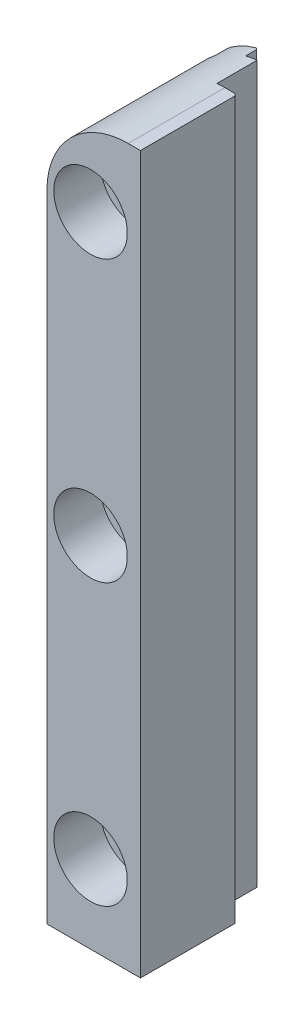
ISO-10303-21;
HEADER;
FILE_DESCRIPTION(('STEP AP214'),'2;1');
FILE_NAME('part.step','',(''),(''),'','','');
FILE_SCHEMA(('AUTOMOTIVE_DESIGN { 1 0 10303 214 1 1 1 1 }'));
ENDSEC;
DATA;
#1=APPLICATION_CONTEXT('core data for automotive mechanical design processes');
#2=APPLICATION_PROTOCOL_DEFINITION('international standard','automotive_design',2000,#1);
#3=PRODUCT_CONTEXT('',#1,'mechanical');
#4=PRODUCT('Part','Part','',(#3));
#5=PRODUCT_RELATED_PRODUCT_CATEGORY('part','',(#4));
#6=PRODUCT_DEFINITION_FORMATION('','',#4);
#7=PRODUCT_DEFINITION_CONTEXT('part definition',#1,'design');
#8=PRODUCT_DEFINITION('design','',#6,#7);
#9=PRODUCT_DEFINITION_SHAPE('','',#8);
#10=(LENGTH_UNIT() NAMED_UNIT(*) SI_UNIT(.MILLI.,.METRE.));
#11=(NAMED_UNIT(*) PLANE_ANGLE_UNIT() SI_UNIT($,.RADIAN.));
#12=(NAMED_UNIT(*) SI_UNIT($,.STERADIAN.) SOLID_ANGLE_UNIT());
#13=UNCERTAINTY_MEASURE_WITH_UNIT(LENGTH_MEASURE(1.E-05),#10,'distance_accuracy_value','');
#14=(GEOMETRIC_REPRESENTATION_CONTEXT(3) GLOBAL_UNCERTAINTY_ASSIGNED_CONTEXT((#13)) GLOBAL_UNIT_ASSIGNED_CONTEXT((#10,
#11,#12)) REPRESENTATION_CONTEXT('',''));
#15=CARTESIAN_POINT('',(0.,0.,0.));
#16=DIRECTION('',(0.,0.,1.));
#17=DIRECTION('',(1.,0.,0.));
#18=AXIS2_PLACEMENT_3D('',#15,#16,#17);
#19=CARTESIAN_POINT('',(-7.32028,42.545,-16.256));
#20=DIRECTION('',(0.,0.,-1.));
#21=DIRECTION('',(1.,0.,0.));
#22=AXIS2_PLACEMENT_3D('',#19,#20,#21);
#23=PLANE('',#22);
#24=CARTESIAN_POINT('',(-5.92328,-33.274,-16.256));
#25=DIRECTION('',(0.,0.,-1.));
#26=DIRECTION('',(-1.,0.,0.));
#27=AXIS2_PLACEMENT_3D('',#24,#25,#26);
#28=CIRCLE('',#27,2.7051);
#29=CARTESIAN_POINT('',(-8.62838,-33.274,-16.256));
#30=VERTEX_POINT('',#29);
#31=EDGE_CURVE('E474',#30,#30,#28,.T.);
#32=ORIENTED_EDGE('',*,*,#31,.F.);
#33=EDGE_LOOP('',(#32));
#34=FACE_BOUND('',#33,.T.);
#35=CARTESIAN_POINT('',(-5.92328,0.,-16.256));
#36=DIRECTION('',(0.,0.,-1.));
#37=DIRECTION('',(-1.,0.,0.));
#38=AXIS2_PLACEMENT_3D('',#35,#36,#37);
#39=CIRCLE('',#38,2.7051);
#40=CARTESIAN_POINT('',(-8.62838,0.,-16.256));
#41=VERTEX_POINT('',#40);
#42=EDGE_CURVE('E477',#41,#41,#39,.T.);
#43=ORIENTED_EDGE('',*,*,#42,.F.);
#44=EDGE_LOOP('',(#43));
#45=FACE_BOUND('',#44,.T.);
#46=CARTESIAN_POINT('',(-5.92328,33.274,-16.256));
#47=DIRECTION('',(0.,0.,-1.));
#48=DIRECTION('',(-1.,0.,0.));
#49=AXIS2_PLACEMENT_3D('',#46,#47,#48);
#50=CIRCLE('',#49,2.7051);
#51=CARTESIAN_POINT('',(-8.62838,33.274,-16.256));
#52=VERTEX_POINT('',#51);
#53=EDGE_CURVE('E480',#52,#52,#50,.T.);
#54=ORIENTED_EDGE('',*,*,#53,.F.);
#55=EDGE_LOOP('',(#54));
#56=FACE_BOUND('',#55,.T.);
#57=DIRECTION('',(-0.999999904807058,0.000436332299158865,0.));
#58=VECTOR('',#57,1.);
#59=CARTESIAN_POINT('',(-7.32432497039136,33.2746113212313,-16.256));
#60=LINE('',#59,#58);
#61=CARTESIAN_POINT('',(-2.74802630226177,33.2726145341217,-16.256));
#62=VERTEX_POINT('',#61);
#63=CARTESIAN_POINT('',(-2.74828030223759,33.2726146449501,-16.256));
#64=VERTEX_POINT('',#63);
#65=EDGE_CURVE('E9',#62,#64,#60,.T.);
#66=ORIENTED_EDGE('',*,*,#65,.T.);
#67=CARTESIAN_POINT('',(-5.92328,33.274,-16.256));
#68=DIRECTION('',(0.,0.,1.));
#69=DIRECTION('',(1.,0.,0.));
#70=AXIS2_PLACEMENT_3D('',#67,#68,#69);
#71=CIRCLE('',#70,3.175);
#72=CARTESIAN_POINT('',(-2.74828,33.274,-16.256));
#73=VERTEX_POINT('',#72);
#74=EDGE_CURVE('E451',#73,#64,#71,.T.);
#75=ORIENTED_EDGE('',*,*,#74,.F.);
#76=DIRECTION('',(-1.,0.,0.));
#77=VECTOR('',#76,1.);
#78=CARTESIAN_POINT('',(-7.32028,33.274,-16.256));
#79=LINE('',#78,#77);
#80=CARTESIAN_POINT('',(-2.748026,33.274,-16.256));
#81=VERTEX_POINT('',#80);
#82=EDGE_CURVE('E23',#73,#81,#79,.F.);
#83=ORIENTED_EDGE('',*,*,#82,.T.);
#84=CARTESIAN_POINT('',(-5.92328,33.274,-16.256));
#85=DIRECTION('',(0.,0.,-1.));
#86=DIRECTION('',(-1.,0.,0.));
#87=AXIS2_PLACEMENT_3D('',#84,#85,#86);
#88=CIRCLE('',#87,3.175254);
#89=CARTESIAN_POINT('',(-3.76428,35.6022948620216,-16.256));
#90=VERTEX_POINT('',#89);
#91=EDGE_CURVE('E303',#90,#81,#88,.T.);
#92=ORIENTED_EDGE('',*,*,#91,.F.);
#93=DIRECTION('',(0.,-1.,0.));
#94=VECTOR('',#93,1.);
#95=CARTESIAN_POINT('',(-3.76428,42.545,-16.256));
#96=LINE('',#95,#94);
#97=CARTESIAN_POINT('',(-3.76428,42.2641543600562,-16.256));
#98=VERTEX_POINT('',#97);
#99=EDGE_CURVE('E544',#98,#90,#96,.T.);
#100=ORIENTED_EDGE('',*,*,#99,.F.);
#101=CARTESIAN_POINT('',(-1.45288,32.893,-16.256));
#102=DIRECTION('',(0.,0.,1.));
#103=DIRECTION('',(1.,0.,0.));
#104=AXIS2_PLACEMENT_3D('',#101,#102,#103);
#105=CIRCLE('',#104,9.652);
#106=CARTESIAN_POINT('',(-2.40538,42.4978866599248,-16.256));
#107=VERTEX_POINT('',#106);
#108=EDGE_CURVE('E664',#107,#98,#105,.T.);
#109=ORIENTED_EDGE('',*,*,#108,.F.);
#110=DIRECTION('',(0.,-1.,0.));
#111=VECTOR('',#110,1.);
#112=CARTESIAN_POINT('',(-2.40538,42.545,-16.256));
#113=LINE('',#112,#111);
#114=CARTESIAN_POINT('',(-2.40538,-42.545,-16.256));
#115=VERTEX_POINT('',#114);
#116=EDGE_CURVE('E658',#107,#115,#113,.T.);
#117=ORIENTED_EDGE('',*,*,#116,.T.);
#118=DIRECTION('',(-1.,0.,0.));
#119=VECTOR('',#118,1.);
#120=CARTESIAN_POINT('',(-2.34188,-42.545,-16.256));
#121=LINE('',#120,#119);
#122=CARTESIAN_POINT('',(-3.76428,-42.545,-16.256));
#123=VERTEX_POINT('',#122);
#124=EDGE_CURVE('E491',#115,#123,#121,.T.);
#125=ORIENTED_EDGE('',*,*,#124,.T.);
#126=CARTESIAN_POINT('',(-3.76428,-35.6022948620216,-16.256));
#127=VERTEX_POINT('',#126);
#128=EDGE_CURVE('E591',#127,#123,#96,.T.);
#129=ORIENTED_EDGE('',*,*,#128,.F.);
#130=CARTESIAN_POINT('',(-5.92328,-33.274,-16.256));
#131=DIRECTION('',(0.,0.,-1.));
#132=DIRECTION('',(-1.,0.,0.));
#133=AXIS2_PLACEMENT_3D('',#130,#131,#132);
#134=CIRCLE('',#133,3.175254);
#135=CARTESIAN_POINT('',(-2.74802630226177,-33.2753854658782,-16.256));
#136=VERTEX_POINT('',#135);
#137=EDGE_CURVE('E428',#136,#127,#134,.T.);
#138=ORIENTED_EDGE('',*,*,#137,.F.);
#139=DIRECTION('',(-0.999999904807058,0.00043633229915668,0.));
#140=VECTOR('',#139,1.);
#141=CARTESIAN_POINT('',(-7.3533620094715,-33.2733760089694,-16.256));
#142=LINE('',#141,#140);
#143=CARTESIAN_POINT('',(-2.74828030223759,-33.2753853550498,-16.256));
#144=VERTEX_POINT('',#143);
#145=EDGE_CURVE('E540',#136,#144,#142,.T.);
#146=ORIENTED_EDGE('',*,*,#145,.T.);
#147=CARTESIAN_POINT('',(-5.92328,-33.274,-16.256));
#148=DIRECTION('',(0.,0.,1.));
#149=DIRECTION('',(1.,0.,0.));
#150=AXIS2_PLACEMENT_3D('',#147,#148,#149);
#151=CIRCLE('',#150,3.175);
#152=CARTESIAN_POINT('',(-2.74828,-33.274,-16.256));
#153=VERTEX_POINT('',#152);
#154=EDGE_CURVE('E447',#153,#144,#151,.T.);
#155=ORIENTED_EDGE('',*,*,#154,.F.);
#156=DIRECTION('',(-1.,0.,0.));
#157=VECTOR('',#156,1.);
#158=CARTESIAN_POINT('',(-7.32028,-33.274,-16.256));
#159=LINE('',#158,#157);
#160=CARTESIAN_POINT('',(-2.748026,-33.274,-16.256));
#161=VERTEX_POINT('',#160);
#162=EDGE_CURVE('E584',#153,#161,#159,.F.);
#163=ORIENTED_EDGE('',*,*,#162,.T.);
#164=CARTESIAN_POINT('',(-3.76428,-30.9457051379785,-16.256));
#165=VERTEX_POINT('',#164);
#166=EDGE_CURVE('E431',#165,#161,#134,.T.);
#167=ORIENTED_EDGE('',*,*,#166,.F.);
#168=CARTESIAN_POINT('',(-3.76428,-2.32829486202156,-16.256));
#169=VERTEX_POINT('',#168);
#170=EDGE_CURVE('E534',#169,#165,#96,.T.);
#171=ORIENTED_EDGE('',*,*,#170,.F.);
#172=CARTESIAN_POINT('',(-5.92328,0.,-16.256));
#173=DIRECTION('',(0.,0.,-1.));
#174=DIRECTION('',(-1.,0.,0.));
#175=AXIS2_PLACEMENT_3D('',#172,#173,#174);
#176=CIRCLE('',#175,3.175254);
#177=CARTESIAN_POINT('',(-2.74802630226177,-0.00138546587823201,-16.256));
#178=VERTEX_POINT('',#177);
#179=EDGE_CURVE('E382',#178,#169,#176,.T.);
#180=ORIENTED_EDGE('',*,*,#179,.F.);
#181=DIRECTION('',(-0.999999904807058,0.000436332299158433,0.));
#182=VECTOR('',#181,1.);
#183=CARTESIAN_POINT('',(-7.33884348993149,0.000617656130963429,-16.256));
#184=LINE('',#183,#182);
#185=CARTESIAN_POINT('',(-2.74828030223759,-0.00138535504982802,-16.256));
#186=VERTEX_POINT('',#185);
#187=EDGE_CURVE('E539',#178,#186,#184,.T.);
#188=ORIENTED_EDGE('',*,*,#187,.T.);
#189=CARTESIAN_POINT('',(-5.92328,0.,-16.256));
#190=DIRECTION('',(0.,0.,1.));
#191=DIRECTION('',(1.,0.,0.));
#192=AXIS2_PLACEMENT_3D('',#189,#190,#191);
#193=CIRCLE('',#192,3.175);
#194=CARTESIAN_POINT('',(-2.74828,0.,-16.256));
#195=VERTEX_POINT('',#194);
#196=EDGE_CURVE('E449',#195,#186,#193,.T.);
#197=ORIENTED_EDGE('',*,*,#196,.F.);
#198=DIRECTION('',(-1.,0.,0.));
#199=VECTOR('',#198,1.);
#200=CARTESIAN_POINT('',(-7.32028,0.,-16.256));
#201=LINE('',#200,#199);
#202=CARTESIAN_POINT('',(-2.748026,0.,-16.256));
#203=VERTEX_POINT('',#202);
#204=EDGE_CURVE('E536',#195,#203,#201,.F.);
#205=ORIENTED_EDGE('',*,*,#204,.T.);
#206=CARTESIAN_POINT('',(-3.76428,2.32829486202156,-16.256));
#207=VERTEX_POINT('',#206);
#208=EDGE_CURVE('E383',#207,#203,#176,.T.);
#209=ORIENTED_EDGE('',*,*,#208,.F.);
#210=CARTESIAN_POINT('',(-3.76428,30.9457051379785,-16.256));
#211=VERTEX_POINT('',#210);
#212=EDGE_CURVE('E543',#211,#207,#96,.T.);
#213=ORIENTED_EDGE('',*,*,#212,.F.);
#214=EDGE_CURVE('E334',#62,#211,#88,.T.);
#215=ORIENTED_EDGE('',*,*,#214,.F.);
#216=EDGE_LOOP('',(#66,#75,#83,#92,#100,#109,#117,#125,#129,#138,#146,#155,#163,#167,#171,#180,
#188,#197,#205,#209,#213,#215));
#217=FACE_BOUND('',#216,.T.);
#218=ADVANCED_FACE('F15',(#34,#45,#56,#217),#23,.T.);
#219=CARTESIAN_POINT('',(-5.92328,33.274,-5.5372));
#220=DIRECTION('',(0.,0.,-1.));
#221=DIRECTION('',(-1.,0.,0.));
#222=AXIS2_PLACEMENT_3D('',#219,#220,#221);
#223=PLANE('',#222);
#224=CARTESIAN_POINT('',(-5.92328,33.274,-5.5372));
#225=DIRECTION('',(0.,0.,-1.));
#226=DIRECTION('',(-1.,0.,0.));
#227=AXIS2_PLACEMENT_3D('',#224,#225,#226);
#228=CIRCLE('',#227,2.7051);
#229=CARTESIAN_POINT('',(-8.62838,33.274,-5.5372));
#230=VERTEX_POINT('',#229);
#231=EDGE_CURVE('E457',#230,#230,#228,.F.);
#232=ORIENTED_EDGE('',*,*,#231,.F.);
#233=EDGE_LOOP('',(#232));
#234=FACE_BOUND('',#233,.T.);
#235=CARTESIAN_POINT('',(-5.92328,33.274,-5.5372));
#236=DIRECTION('',(0.,0.,-1.));
#237=DIRECTION('',(-1.,0.,0.));
#238=AXIS2_PLACEMENT_3D('',#235,#236,#237);
#239=CIRCLE('',#238,4.365625);
#240=CARTESIAN_POINT('',(-10.288905,33.274,-5.5372));
#241=VERTEX_POINT('',#240);
#242=EDGE_CURVE('E454',#241,#241,#239,.T.);
#243=ORIENTED_EDGE('',*,*,#242,.F.);
#244=EDGE_LOOP('',(#243));
#245=FACE_BOUND('',#244,.T.);
#246=CARTESIAN_POINT('',(-5.92328,33.274,-5.5372));
#247=DIRECTION('',(0.,0.,1.));
#248=DIRECTION('',(1.,0.,0.));
#249=AXIS2_PLACEMENT_3D('',#246,#247,#248);
#250=CIRCLE('',#249,3.175254);
#251=CARTESIAN_POINT('',(-2.748026,33.274,-5.5372));
#252=VERTEX_POINT('',#251);
#253=CARTESIAN_POINT('',(-2.74802630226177,33.2726145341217,-5.5372));
#254=VERTEX_POINT('',#253);
#255=EDGE_CURVE('E300',#252,#254,#250,.T.);
#256=ORIENTED_EDGE('',*,*,#255,.F.);
#257=DIRECTION('',(1.,0.,0.));
#258=VECTOR('',#257,1.);
#259=CARTESIAN_POINT('',(-2.74828,33.274,-5.5372));
#260=LINE('',#259,#258);
#261=CARTESIAN_POINT('',(-2.74828,33.274,-5.5372));
#262=VERTEX_POINT('',#261);
#263=EDGE_CURVE('E308',#252,#262,#260,.F.);
#264=ORIENTED_EDGE('',*,*,#263,.T.);
#265=CARTESIAN_POINT('',(-5.92328,33.274,-5.5372));
#266=DIRECTION('',(0.,0.,1.));
#267=DIRECTION('',(1.,0.,0.));
#268=AXIS2_PLACEMENT_3D('',#265,#266,#267);
#269=CIRCLE('',#268,3.175);
#270=CARTESIAN_POINT('',(-2.74828030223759,33.2726146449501,-5.5372));
#271=VERTEX_POINT('',#270);
#272=EDGE_CURVE('E323',#262,#271,#269,.T.);
#273=ORIENTED_EDGE('',*,*,#272,.T.);
#274=DIRECTION('',(0.999999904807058,-0.000436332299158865,0.));
#275=VECTOR('',#274,1.);
#276=CARTESIAN_POINT('',(-2.74828030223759,33.2726146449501,-5.5372));
#277=LINE('',#276,#275);
#278=EDGE_CURVE('E313',#254,#271,#277,.F.);
#279=ORIENTED_EDGE('',*,*,#278,.F.);
#280=EDGE_LOOP('',(#256,#264,#273,#279));
#281=FACE_BOUND('',#280,.T.);
#282=ADVANCED_FACE('F316',(#234,#245,#281),#223,.F.);
#283=CARTESIAN_POINT('',(-7.32028,30.4225742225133,-16.256));
#284=VERTEX_POINT('',#283);
#285=CARTESIAN_POINT('',(-7.32028,36.1254257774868,-16.256));
#286=VERTEX_POINT('',#285);
#287=EDGE_CURVE('E331',#284,#286,#88,.T.);
#288=ORIENTED_EDGE('',*,*,#287,.F.);
#289=DIRECTION('',(0.,-1.,0.));
#290=VECTOR('',#289,1.);
#291=CARTESIAN_POINT('',(-7.32028,42.545,-16.256));
#292=LINE('',#291,#290);
#293=CARTESIAN_POINT('',(-7.32028,2.85142577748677,-16.256));
#294=VERTEX_POINT('',#293);
#295=EDGE_CURVE('E533',#284,#294,#292,.T.);
#296=ORIENTED_EDGE('',*,*,#295,.T.);
#297=CARTESIAN_POINT('',(-7.32028,-2.85142577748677,-16.256));
#298=VERTEX_POINT('',#297);
#299=EDGE_CURVE('E378',#298,#294,#176,.T.);
#300=ORIENTED_EDGE('',*,*,#299,.F.);
#301=CARTESIAN_POINT('',(-7.32028,-30.4225742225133,-16.256));
#302=VERTEX_POINT('',#301);
#303=EDGE_CURVE('E530',#298,#302,#292,.T.);
#304=ORIENTED_EDGE('',*,*,#303,.T.);
#305=CARTESIAN_POINT('',(-7.32028,-36.1254257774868,-16.256));
#306=VERTEX_POINT('',#305);
#307=EDGE_CURVE('E432',#306,#302,#134,.T.);
#308=ORIENTED_EDGE('',*,*,#307,.F.);
#309=CARTESIAN_POINT('',(-7.32028,-42.545,-16.256));
#310=VERTEX_POINT('',#309);
#311=EDGE_CURVE('E526',#306,#310,#292,.T.);
#312=ORIENTED_EDGE('',*,*,#311,.T.);
#313=DIRECTION('',(-1.,0.,0.));
#314=VECTOR('',#313,1.);
#315=CARTESIAN_POINT('',(-7.32028,-42.545,-16.256));
#316=LINE('',#315,#314);
#317=CARTESIAN_POINT('',(-11.10488,-42.545,-16.256));
#318=VERTEX_POINT('',#317);
#319=EDGE_CURVE('E503',#310,#318,#316,.T.);
#320=ORIENTED_EDGE('',*,*,#319,.T.);
#321=DIRECTION('',(0.,-1.,0.));
#322=VECTOR('',#321,1.);
#323=CARTESIAN_POINT('',(-11.10488,42.545,-16.256));
#324=LINE('',#323,#322);
#325=CARTESIAN_POINT('',(-11.10488,32.893,-16.256));
#326=VERTEX_POINT('',#325);
#327=EDGE_CURVE('E512',#326,#318,#324,.T.);
#328=ORIENTED_EDGE('',*,*,#327,.F.);
#329=CARTESIAN_POINT('',(-1.45288,32.893,-16.256));
#330=DIRECTION('',(0.,0.,1.));
#331=DIRECTION('',(1.,0.,0.));
#332=AXIS2_PLACEMENT_3D('',#329,#330,#331);
#333=CIRCLE('',#332,9.652);
#334=CARTESIAN_POINT('',(-7.32028,40.5568581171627,-16.256));
#335=VERTEX_POINT('',#334);
#336=EDGE_CURVE('E604',#335,#326,#333,.T.);
#337=ORIENTED_EDGE('',*,*,#336,.F.);
#338=EDGE_CURVE('E520',#335,#286,#292,.T.);
#339=ORIENTED_EDGE('',*,*,#338,.T.);
#340=EDGE_LOOP('',(#288,#296,#300,#304,#308,#312,#320,#328,#337,#339));
#341=FACE_BOUND('',#340,.T.);
#342=ADVANCED_FACE('F601',(#341),#23,.T.);
#343=CARTESIAN_POINT('',(-5.92328,0.,-5.5372));
#344=DIRECTION('',(0.,0.,-1.));
#345=DIRECTION('',(-1.,0.,0.));
#346=AXIS2_PLACEMENT_3D('',#343,#344,#345);
#347=PLANE('',#346);
#348=CARTESIAN_POINT('',(-5.92328,0.,-5.5372));
#349=DIRECTION('',(0.,0.,-1.));
#350=DIRECTION('',(-1.,0.,0.));
#351=AXIS2_PLACEMENT_3D('',#348,#349,#350);
#352=CIRCLE('',#351,2.7051);
#353=CARTESIAN_POINT('',(-8.62838,0.,-5.5372));
#354=VERTEX_POINT('',#353);
#355=EDGE_CURVE('E463',#354,#354,#352,.F.);
#356=ORIENTED_EDGE('',*,*,#355,.F.);
#357=EDGE_LOOP('',(#356));
#358=FACE_BOUND('',#357,.T.);
#359=CARTESIAN_POINT('',(-5.92328,0.,-5.5372));
#360=DIRECTION('',(0.,0.,-1.));
#361=DIRECTION('',(-1.,0.,0.));
#362=AXIS2_PLACEMENT_3D('',#359,#360,#361);
#363=CIRCLE('',#362,4.365625);
#364=CARTESIAN_POINT('',(-10.288905,0.,-5.5372));
#365=VERTEX_POINT('',#364);
#366=EDGE_CURVE('E460',#365,#365,#363,.T.);
#367=ORIENTED_EDGE('',*,*,#366,.F.);
#368=EDGE_LOOP('',(#367));
#369=FACE_BOUND('',#368,.T.);
#370=CARTESIAN_POINT('',(-5.92328,0.,-5.5372));
#371=DIRECTION('',(0.,0.,1.));
#372=DIRECTION('',(1.,0.,0.));
#373=AXIS2_PLACEMENT_3D('',#370,#371,#372);
#374=CIRCLE('',#373,3.175254);
#375=CARTESIAN_POINT('',(-2.748026,0.,-5.5372));
#376=VERTEX_POINT('',#375);
#377=CARTESIAN_POINT('',(-2.74802630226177,-0.00138546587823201,-5.5372));
#378=VERTEX_POINT('',#377);
#379=EDGE_CURVE('E351',#376,#378,#374,.T.);
#380=ORIENTED_EDGE('',*,*,#379,.F.);
#381=DIRECTION('',(1.,0.,0.));
#382=VECTOR('',#381,1.);
#383=CARTESIAN_POINT('',(-2.74828,0.,-5.5372));
#384=LINE('',#383,#382);
#385=CARTESIAN_POINT('',(-2.74828,0.,-5.5372));
#386=VERTEX_POINT('',#385);
#387=EDGE_CURVE('E366',#376,#386,#384,.F.);
#388=ORIENTED_EDGE('',*,*,#387,.T.);
#389=CARTESIAN_POINT('',(-5.92328,0.,-5.5372));
#390=DIRECTION('',(0.,0.,1.));
#391=DIRECTION('',(1.,0.,0.));
#392=AXIS2_PLACEMENT_3D('',#389,#390,#391);
#393=CIRCLE('',#392,3.175);
#394=CARTESIAN_POINT('',(-2.74828030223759,-0.00138535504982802,-5.5372));
#395=VERTEX_POINT('',#394);
#396=EDGE_CURVE('E359',#386,#395,#393,.T.);
#397=ORIENTED_EDGE('',*,*,#396,.T.);
#398=DIRECTION('',(0.999999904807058,-0.000436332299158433,0.));
#399=VECTOR('',#398,1.);
#400=CARTESIAN_POINT('',(-2.74828030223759,-0.00138535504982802,-5.5372));
#401=LINE('',#400,#399);
#402=EDGE_CURVE('E363',#378,#395,#401,.F.);
#403=ORIENTED_EDGE('',*,*,#402,.F.);
#404=EDGE_LOOP('',(#380,#388,#397,#403));
#405=FACE_BOUND('',#404,.T.);
#406=ADVANCED_FACE('F754',(#358,#369,#405),#347,.F.);
#407=CARTESIAN_POINT('',(-5.92328,-33.274,-5.5372));
#408=DIRECTION('',(0.,0.,-1.));
#409=DIRECTION('',(-1.,0.,0.));
#410=AXIS2_PLACEMENT_3D('',#407,#408,#409);
#411=PLANE('',#410);
#412=CARTESIAN_POINT('',(-5.92328,-33.274,-5.5372));
#413=DIRECTION('',(0.,0.,-1.));
#414=DIRECTION('',(-1.,0.,0.));
#415=AXIS2_PLACEMENT_3D('',#412,#413,#414);
#416=CIRCLE('',#415,2.7051);
#417=CARTESIAN_POINT('',(-8.62838,-33.274,-5.5372));
#418=VERTEX_POINT('',#417);
#419=EDGE_CURVE('E470',#418,#418,#416,.F.);
#420=ORIENTED_EDGE('',*,*,#419,.F.);
#421=EDGE_LOOP('',(#420));
#422=FACE_BOUND('',#421,.T.);
#423=CARTESIAN_POINT('',(-5.92328,-33.274,-5.5372));
#424=DIRECTION('',(0.,0.,-1.));
#425=DIRECTION('',(-1.,0.,0.));
#426=AXIS2_PLACEMENT_3D('',#423,#424,#425);
#427=CIRCLE('',#426,4.365625);
#428=CARTESIAN_POINT('',(-10.288905,-33.274,-5.5372));
#429=VERTEX_POINT('',#428);
#430=EDGE_CURVE('E467',#429,#429,#427,.T.);
#431=ORIENTED_EDGE('',*,*,#430,.F.);
#432=EDGE_LOOP('',(#431));
#433=FACE_BOUND('',#432,.T.);
#434=CARTESIAN_POINT('',(-5.92328,-33.274,-5.5372));
#435=DIRECTION('',(0.,0.,1.));
#436=DIRECTION('',(1.,0.,0.));
#437=AXIS2_PLACEMENT_3D('',#434,#435,#436);
#438=CIRCLE('',#437,3.175254);
#439=CARTESIAN_POINT('',(-2.748026,-33.274,-5.5372));
#440=VERTEX_POINT('',#439);
#441=CARTESIAN_POINT('',(-2.74802630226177,-33.2753854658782,-5.5372));
#442=VERTEX_POINT('',#441);
#443=EDGE_CURVE('E401',#440,#442,#438,.T.);
#444=ORIENTED_EDGE('',*,*,#443,.F.);
#445=DIRECTION('',(1.,0.,0.));
#446=VECTOR('',#445,1.);
#447=CARTESIAN_POINT('',(-2.74828,-33.274,-5.5372));
#448=LINE('',#447,#446);
#449=CARTESIAN_POINT('',(-2.74828,-33.274,-5.5372));
#450=VERTEX_POINT('',#449);
#451=EDGE_CURVE('E416',#440,#450,#448,.F.);
#452=ORIENTED_EDGE('',*,*,#451,.T.);
#453=CARTESIAN_POINT('',(-5.92328,-33.274,-5.5372));
#454=DIRECTION('',(0.,0.,1.));
#455=DIRECTION('',(1.,0.,0.));
#456=AXIS2_PLACEMENT_3D('',#453,#454,#455);
#457=CIRCLE('',#456,3.175);
#458=CARTESIAN_POINT('',(-2.74828030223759,-33.2753853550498,-5.5372));
#459=VERTEX_POINT('',#458);
#460=EDGE_CURVE('E409',#450,#459,#457,.T.);
#461=ORIENTED_EDGE('',*,*,#460,.T.);
#462=DIRECTION('',(0.999999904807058,-0.00043633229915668,0.));
#463=VECTOR('',#462,1.);
#464=CARTESIAN_POINT('',(-2.74828030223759,-33.2753853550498,-5.5372));
#465=LINE('',#464,#463);
#466=EDGE_CURVE('E413',#442,#459,#465,.F.);
#467=ORIENTED_EDGE('',*,*,#466,.F.);
#468=EDGE_LOOP('',(#444,#452,#461,#467));
#469=FACE_BOUND('',#468,.T.);
#470=ADVANCED_FACE('F758',(#422,#433,#469),#411,.F.);
#471=CARTESIAN_POINT('',(-3.76428,42.545,-16.256));
#472=DIRECTION('',(1.,0.,0.));
#473=DIRECTION('',(0.,0.,1.));
#474=AXIS2_PLACEMENT_3D('',#471,#472,#473);
#475=PLANE('',#474);
#476=DIRECTION('',(0.,0.,1.));
#477=VECTOR('',#476,1.);
#478=CARTESIAN_POINT('',(-3.76428,-35.6022948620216,-5.5372));
#479=LINE('',#478,#477);
#480=CARTESIAN_POINT('',(-3.76428,-35.6022948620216,-17.526));
#481=VERTEX_POINT('',#480);
#482=EDGE_CURVE('E426',#127,#481,#479,.F.);
#483=ORIENTED_EDGE('',*,*,#482,.F.);
#484=ORIENTED_EDGE('',*,*,#128,.T.);
#485=DIRECTION('',(0.,0.,-1.));
#486=VECTOR('',#485,1.);
#487=CARTESIAN_POINT('',(-3.76428,-42.545,-16.256));
#488=LINE('',#487,#486);
#489=CARTESIAN_POINT('',(-3.76428,-42.545,-17.526));
#490=VERTEX_POINT('',#489);
#491=EDGE_CURVE('E494',#123,#490,#488,.T.);
#492=ORIENTED_EDGE('',*,*,#491,.T.);
#493=DIRECTION('',(0.,1.,0.));
#494=VECTOR('',#493,1.);
#495=CARTESIAN_POINT('',(-3.76428,42.545,-17.526));
#496=LINE('',#495,#494);
#497=EDGE_CURVE('E570',#490,#481,#496,.T.);
#498=ORIENTED_EDGE('',*,*,#497,.T.);
#499=EDGE_LOOP('',(#483,#484,#492,#498));
#500=FACE_BOUND('',#499,.T.);
#501=ADVANCED_FACE('F716',(#500),#475,.T.);
#502=CARTESIAN_POINT('',(-7.32028,42.545,-17.526));
#503=DIRECTION('',(0.707106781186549,0.,0.707106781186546));
#504=DIRECTION('',(0.707106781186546,0.,-0.707106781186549));
#505=AXIS2_PLACEMENT_3D('',#502,#503,#504);
#506=PLANE('',#505);
#507=CARTESIAN_POINT('',(-5.92328,-33.274,-18.923));
#508=DIRECTION('',(0.707106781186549,0.,0.707106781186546));
#509=DIRECTION('',(-0.707106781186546,0.,0.707106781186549));
#510=AXIS2_PLACEMENT_3D('',#507,#508,#509);
#511=ELLIPSE('',#510,4.49048727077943,3.175254);
#512=CARTESIAN_POINT('',(-7.06628,-36.2363958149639,-17.78));
#513=VERTEX_POINT('',#512);
#514=CARTESIAN_POINT('',(-7.32028,-36.1254257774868,-17.526));
#515=VERTEX_POINT('',#514);
#516=EDGE_CURVE('E424',#513,#515,#511,.F.);
#517=ORIENTED_EDGE('',*,*,#516,.F.);
#518=DIRECTION('',(0.,1.,0.));
#519=VECTOR('',#518,1.);
#520=CARTESIAN_POINT('',(-7.06628,42.545,-17.78));
#521=LINE('',#520,#519);
#522=CARTESIAN_POINT('',(-7.06628,-42.545,-17.78));
#523=VERTEX_POINT('',#522);
#524=EDGE_CURVE('E629',#523,#513,#521,.T.);
#525=ORIENTED_EDGE('',*,*,#524,.F.);
#526=DIRECTION('',(-0.707106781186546,0.,0.707106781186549));
#527=VECTOR('',#526,1.);
#528=CARTESIAN_POINT('',(-7.32028,-42.545,-17.526));
#529=LINE('',#528,#527);
#530=CARTESIAN_POINT('',(-7.32028,-42.545,-17.526));
#531=VERTEX_POINT('',#530);
#532=EDGE_CURVE('E653',#531,#523,#529,.F.);
#533=ORIENTED_EDGE('',*,*,#532,.F.);
#534=DIRECTION('',(0.,-1.,0.));
#535=VECTOR('',#534,1.);
#536=CARTESIAN_POINT('',(-7.32028,42.545,-17.526));
#537=LINE('',#536,#535);
#538=EDGE_CURVE('E580',#515,#531,#537,.T.);
#539=ORIENTED_EDGE('',*,*,#538,.F.);
#540=EDGE_LOOP('',(#517,#525,#533,#539));
#541=FACE_BOUND('',#540,.T.);
#542=ADVANCED_FACE('F738',(#541),#506,.F.);
#543=CARTESIAN_POINT('',(-3.76428,42.545,-17.78));
#544=DIRECTION('',(0.,0.,-1.));
#545=DIRECTION('',(1.,0.,0.));
#546=AXIS2_PLACEMENT_3D('',#543,#544,#545);
#547=PLANE('',#546);
#548=CARTESIAN_POINT('',(-5.92328,0.,-17.78));
#549=DIRECTION('',(0.,0.,-1.));
#550=DIRECTION('',(-1.,0.,0.));
#551=AXIS2_PLACEMENT_3D('',#548,#549,#550);
#552=CIRCLE('',#551,3.175254);
#553=CARTESIAN_POINT('',(-4.01828,-2.54031749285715,-17.78));
#554=VERTEX_POINT('',#553);
#555=CARTESIAN_POINT('',(-7.06628,-2.96239581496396,-17.78));
#556=VERTEX_POINT('',#555);
#557=EDGE_CURVE('E392',#554,#556,#552,.T.);
#558=ORIENTED_EDGE('',*,*,#557,.F.);
#559=DIRECTION('',(0.,-1.,0.));
#560=VECTOR('',#559,1.);
#561=CARTESIAN_POINT('',(-4.01828,42.545,-17.78));
#562=LINE('',#561,#560);
#563=CARTESIAN_POINT('',(-4.01828,-30.7336825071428,-17.78));
#564=VERTEX_POINT('',#563);
#565=EDGE_CURVE('E628',#554,#564,#562,.T.);
#566=ORIENTED_EDGE('',*,*,#565,.T.);
#567=CARTESIAN_POINT('',(-5.92328,-33.274,-17.78));
#568=DIRECTION('',(0.,0.,-1.));
#569=DIRECTION('',(-1.,0.,0.));
#570=AXIS2_PLACEMENT_3D('',#567,#568,#569);
#571=CIRCLE('',#570,3.175254);
#572=CARTESIAN_POINT('',(-7.06628,-30.3116041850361,-17.78));
#573=VERTEX_POINT('',#572);
#574=EDGE_CURVE('E439',#573,#564,#571,.T.);
#575=ORIENTED_EDGE('',*,*,#574,.F.);
#576=EDGE_CURVE('E635',#573,#556,#521,.T.);
#577=ORIENTED_EDGE('',*,*,#576,.T.);
#578=EDGE_LOOP('',(#558,#566,#575,#577));
#579=FACE_BOUND('',#578,.T.);
#580=ADVANCED_FACE('F726',(#579),#547,.T.);
#581=CARTESIAN_POINT('',(-7.32028,42.545,-17.78));
#582=DIRECTION('',(-1.,0.,0.));
#583=DIRECTION('',(0.,0.,-1.));
#584=AXIS2_PLACEMENT_3D('',#581,#582,#583);
#585=PLANE('',#584);
#586=DIRECTION('',(0.,0.,1.));
#587=VECTOR('',#586,1.);
#588=CARTESIAN_POINT('',(-7.32028,-2.85142577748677,-5.5372));
#589=LINE('',#588,#587);
#590=CARTESIAN_POINT('',(-7.32028,-2.85142577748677,-17.526));
#591=VERTEX_POINT('',#590);
#592=EDGE_CURVE('E385',#591,#298,#589,.T.);
#593=ORIENTED_EDGE('',*,*,#592,.F.);
#594=CARTESIAN_POINT('',(-7.32028,-30.4225742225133,-17.526));
#595=VERTEX_POINT('',#594);
#596=EDGE_CURVE('E838',#591,#595,#537,.T.);
#597=ORIENTED_EDGE('',*,*,#596,.T.);
#598=DIRECTION('',(0.,0.,1.));
#599=VECTOR('',#598,1.);
#600=CARTESIAN_POINT('',(-7.32028,-30.4225742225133,-5.5372));
#601=LINE('',#600,#599);
#602=EDGE_CURVE('E434',#302,#595,#601,.F.);
#603=ORIENTED_EDGE('',*,*,#602,.F.);
#604=ORIENTED_EDGE('',*,*,#303,.F.);
#605=EDGE_LOOP('',(#593,#597,#603,#604));
#606=FACE_BOUND('',#605,.T.);
#607=ADVANCED_FACE('F735',(#606),#585,.T.);
#608=CARTESIAN_POINT('',(-4.01828,42.545,-17.78));
#609=DIRECTION('',(-0.707106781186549,0.,0.707106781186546));
#610=DIRECTION('',(0.707106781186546,0.,0.707106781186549));
#611=AXIS2_PLACEMENT_3D('',#608,#609,#610);
#612=PLANE('',#611);
#613=CARTESIAN_POINT('',(-5.92328,0.,-19.685));
#614=DIRECTION('',(-0.707106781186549,0.,0.707106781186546));
#615=DIRECTION('',(0.707106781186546,0.,0.707106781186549));
#616=AXIS2_PLACEMENT_3D('',#613,#614,#615);
#617=ELLIPSE('',#616,4.49048727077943,3.175254);
#618=CARTESIAN_POINT('',(-3.76428,-2.32829486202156,-17.526));
#619=VERTEX_POINT('',#618);
#620=EDGE_CURVE('E394',#619,#554,#617,.F.);
#621=ORIENTED_EDGE('',*,*,#620,.F.);
#622=CARTESIAN_POINT('',(-3.76428,-30.9457051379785,-17.526));
#623=VERTEX_POINT('',#622);
#624=EDGE_CURVE('E566',#623,#619,#496,.T.);
#625=ORIENTED_EDGE('',*,*,#624,.F.);
#626=CARTESIAN_POINT('',(-5.92328,-33.274,-19.685));
#627=DIRECTION('',(-0.707106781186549,0.,0.707106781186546));
#628=DIRECTION('',(0.707106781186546,0.,0.707106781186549));
#629=AXIS2_PLACEMENT_3D('',#626,#627,#628);
#630=ELLIPSE('',#629,4.49048727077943,3.175254);
#631=EDGE_CURVE('E442',#564,#623,#630,.F.);
#632=ORIENTED_EDGE('',*,*,#631,.F.);
#633=ORIENTED_EDGE('',*,*,#565,.F.);
#634=EDGE_LOOP('',(#621,#625,#632,#633));
#635=FACE_BOUND('',#634,.T.);
#636=ADVANCED_FACE('F797',(#635),#612,.F.);
#637=DIRECTION('',(0.,0.,1.));
#638=VECTOR('',#637,1.);
#639=CARTESIAN_POINT('',(-3.76428,-2.32829486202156,-5.5372));
#640=LINE('',#639,#638);
#641=EDGE_CURVE('E396',#169,#619,#640,.F.);
#642=ORIENTED_EDGE('',*,*,#641,.F.);
#643=ORIENTED_EDGE('',*,*,#170,.T.);
#644=DIRECTION('',(0.,0.,1.));
#645=VECTOR('',#644,1.);
#646=CARTESIAN_POINT('',(-3.76428,-30.9457051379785,-5.5372));
#647=LINE('',#646,#645);
#648=EDGE_CURVE('E444',#623,#165,#647,.T.);
#649=ORIENTED_EDGE('',*,*,#648,.F.);
#650=ORIENTED_EDGE('',*,*,#624,.T.);
#651=EDGE_LOOP('',(#642,#643,#649,#650));
#652=FACE_BOUND('',#651,.T.);
#653=ADVANCED_FACE('F863',(#652),#475,.T.);
#654=CARTESIAN_POINT('',(-5.92328,0.,-18.923));
#655=DIRECTION('',(0.707106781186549,0.,0.707106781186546));
#656=DIRECTION('',(-0.707106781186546,0.,0.707106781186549));
#657=AXIS2_PLACEMENT_3D('',#654,#655,#656);
#658=ELLIPSE('',#657,4.49048727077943,3.175254);
#659=EDGE_CURVE('E390',#556,#591,#658,.F.);
#660=ORIENTED_EDGE('',*,*,#659,.F.);
#661=ORIENTED_EDGE('',*,*,#576,.F.);
#662=CARTESIAN_POINT('',(-5.92328,-33.274,-18.923));
#663=DIRECTION('',(0.707106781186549,0.,0.707106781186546));
#664=DIRECTION('',(-0.707106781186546,0.,0.707106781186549));
#665=AXIS2_PLACEMENT_3D('',#662,#663,#664);
#666=ELLIPSE('',#665,4.49048727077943,3.175254);
#667=EDGE_CURVE('E437',#595,#573,#666,.F.);
#668=ORIENTED_EDGE('',*,*,#667,.F.);
#669=ORIENTED_EDGE('',*,*,#596,.F.);
#670=EDGE_LOOP('',(#660,#661,#668,#669));
#671=FACE_BOUND('',#670,.T.);
#672=ADVANCED_FACE('F871',(#671),#506,.F.);
#673=CARTESIAN_POINT('',(-5.92328,33.274,-17.78));
#674=DIRECTION('',(0.,0.,-1.));
#675=DIRECTION('',(-1.,0.,0.));
#676=AXIS2_PLACEMENT_3D('',#673,#674,#675);
#677=CIRCLE('',#676,3.175254);
#678=CARTESIAN_POINT('',(-4.01828,30.7336825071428,-17.78));
#679=VERTEX_POINT('',#678);
#680=CARTESIAN_POINT('',(-7.06628,30.3116041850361,-17.78));
#681=VERTEX_POINT('',#680);
#682=EDGE_CURVE('E342',#679,#681,#677,.T.);
#683=ORIENTED_EDGE('',*,*,#682,.F.);
#684=CARTESIAN_POINT('',(-4.01828,2.54031749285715,-17.78));
#685=VERTEX_POINT('',#684);
#686=EDGE_CURVE('E626',#679,#685,#562,.T.);
#687=ORIENTED_EDGE('',*,*,#686,.T.);
#688=CARTESIAN_POINT('',(-5.92328,0.,-17.78));
#689=DIRECTION('',(0.,0.,-1.));
#690=DIRECTION('',(-1.,0.,0.));
#691=AXIS2_PLACEMENT_3D('',#688,#689,#690);
#692=CIRCLE('',#691,3.175254);
#693=CARTESIAN_POINT('',(-7.06628,2.96239581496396,-17.78));
#694=VERTEX_POINT('',#693);
#695=EDGE_CURVE('E375',#694,#685,#692,.T.);
#696=ORIENTED_EDGE('',*,*,#695,.F.);
#697=EDGE_CURVE('E638',#694,#681,#521,.T.);
#698=ORIENTED_EDGE('',*,*,#697,.T.);
#699=EDGE_LOOP('',(#683,#687,#696,#698));
#700=FACE_BOUND('',#699,.T.);
#701=ADVANCED_FACE('F740',(#700),#547,.T.);
#702=DIRECTION('',(0.,0.,1.));
#703=VECTOR('',#702,1.);
#704=CARTESIAN_POINT('',(-7.32028,30.4225742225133,-5.5372));
#705=LINE('',#704,#703);
#706=CARTESIAN_POINT('',(-7.32028,30.4225742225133,-17.526));
#707=VERTEX_POINT('',#706);
#708=EDGE_CURVE('E336',#707,#284,#705,.T.);
#709=ORIENTED_EDGE('',*,*,#708,.F.);
#710=CARTESIAN_POINT('',(-7.32028,2.85142577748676,-17.526));
#711=VERTEX_POINT('',#710);
#712=EDGE_CURVE('E585',#707,#711,#537,.T.);
#713=ORIENTED_EDGE('',*,*,#712,.T.);
#714=DIRECTION('',(0.,0.,1.));
#715=VECTOR('',#714,1.);
#716=CARTESIAN_POINT('',(-7.32028,2.85142577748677,-5.5372));
#717=LINE('',#716,#715);
#718=EDGE_CURVE('E372',#294,#711,#717,.F.);
#719=ORIENTED_EDGE('',*,*,#718,.F.);
#720=ORIENTED_EDGE('',*,*,#295,.F.);
#721=EDGE_LOOP('',(#709,#713,#719,#720));
#722=FACE_BOUND('',#721,.T.);
#723=ADVANCED_FACE('F845',(#722),#585,.T.);
#724=CARTESIAN_POINT('',(-5.92328,33.274,-19.685));
#725=DIRECTION('',(-0.707106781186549,0.,0.707106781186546));
#726=DIRECTION('',(0.707106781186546,0.,0.707106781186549));
#727=AXIS2_PLACEMENT_3D('',#724,#725,#726);
#728=ELLIPSE('',#727,4.49048727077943,3.175254);
#729=CARTESIAN_POINT('',(-3.76428,30.9457051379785,-17.526));
#730=VERTEX_POINT('',#729);
#731=EDGE_CURVE('E344',#730,#679,#728,.F.);
#732=ORIENTED_EDGE('',*,*,#731,.F.);
#733=CARTESIAN_POINT('',(-3.76428,2.32829486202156,-17.526));
#734=VERTEX_POINT('',#733);
#735=EDGE_CURVE('E563',#734,#730,#496,.T.);
#736=ORIENTED_EDGE('',*,*,#735,.F.);
#737=CARTESIAN_POINT('',(-5.92328,0.,-19.685));
#738=DIRECTION('',(-0.707106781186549,0.,0.707106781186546));
#739=DIRECTION('',(0.707106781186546,0.,0.707106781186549));
#740=AXIS2_PLACEMENT_3D('',#737,#738,#739);
#741=ELLIPSE('',#740,4.49048727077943,3.175254);
#742=EDGE_CURVE('E381',#685,#734,#741,.F.);
#743=ORIENTED_EDGE('',*,*,#742,.F.);
#744=ORIENTED_EDGE('',*,*,#686,.F.);
#745=EDGE_LOOP('',(#732,#736,#743,#744));
#746=FACE_BOUND('',#745,.T.);
#747=ADVANCED_FACE('F857',(#746),#612,.F.);
#748=DIRECTION('',(0.,0.,1.));
#749=VECTOR('',#748,1.);
#750=CARTESIAN_POINT('',(-3.76428,30.9457051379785,-5.5372));
#751=LINE('',#750,#749);
#752=EDGE_CURVE('E346',#211,#730,#751,.F.);
#753=ORIENTED_EDGE('',*,*,#752,.F.);
#754=ORIENTED_EDGE('',*,*,#212,.T.);
#755=DIRECTION('',(0.,0.,1.));
#756=VECTOR('',#755,1.);
#757=CARTESIAN_POINT('',(-3.76428,2.32829486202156,-5.5372));
#758=LINE('',#757,#756);
#759=EDGE_CURVE('E387',#734,#207,#758,.T.);
#760=ORIENTED_EDGE('',*,*,#759,.F.);
#761=ORIENTED_EDGE('',*,*,#735,.T.);
#762=EDGE_LOOP('',(#753,#754,#760,#761));
#763=FACE_BOUND('',#762,.T.);
#764=ADVANCED_FACE('F560',(#763),#475,.T.);
#765=CARTESIAN_POINT('',(-5.92328,33.274,-17.78));
#766=DIRECTION('',(0.,0.,-1.));
#767=DIRECTION('',(-1.,0.,0.));
#768=AXIS2_PLACEMENT_3D('',#765,#766,#767);
#769=CIRCLE('',#768,3.175254);
#770=CARTESIAN_POINT('',(-7.06628,36.2363958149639,-17.78));
#771=VERTEX_POINT('',#770);
#772=CARTESIAN_POINT('',(-4.01828,35.8143174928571,-17.78));
#773=VERTEX_POINT('',#772);
#774=EDGE_CURVE('E329',#771,#773,#769,.T.);
#775=ORIENTED_EDGE('',*,*,#774,.F.);
#776=CARTESIAN_POINT('',(-7.06628,40.7448051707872,-17.78));
#777=VERTEX_POINT('',#776);
#778=EDGE_CURVE('E614',#771,#777,#521,.T.);
#779=ORIENTED_EDGE('',*,*,#778,.T.);
#780=CARTESIAN_POINT('',(-1.45288,32.893,-17.78));
#781=DIRECTION('',(0.,0.,1.));
#782=DIRECTION('',(1.,0.,0.));
#783=AXIS2_PLACEMENT_3D('',#780,#781,#782);
#784=CIRCLE('',#783,9.652);
#785=CARTESIAN_POINT('',(-4.01828,42.1978281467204,-17.78));
#786=VERTEX_POINT('',#785);
#787=EDGE_CURVE('E623',#786,#777,#784,.T.);
#788=ORIENTED_EDGE('',*,*,#787,.F.);
#789=EDGE_CURVE('E571',#786,#773,#562,.T.);
#790=ORIENTED_EDGE('',*,*,#789,.T.);
#791=EDGE_LOOP('',(#775,#779,#788,#790));
#792=FACE_BOUND('',#791,.T.);
#793=ADVANCED_FACE('F619',(#792),#547,.T.);
#794=DIRECTION('',(0.,0.,1.));
#795=VECTOR('',#794,1.);
#796=CARTESIAN_POINT('',(-7.32028,36.1254257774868,-5.5372));
#797=LINE('',#796,#795);
#798=CARTESIAN_POINT('',(-7.32028,36.1254257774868,-17.526));
#799=VERTEX_POINT('',#798);
#800=EDGE_CURVE('E30',#286,#799,#797,.F.);
#801=ORIENTED_EDGE('',*,*,#800,.F.);
#802=ORIENTED_EDGE('',*,*,#338,.F.);
#803=DIRECTION('',(0.,0.,1.));
#804=VECTOR('',#803,1.);
#805=CARTESIAN_POINT('',(-7.32028,40.5568581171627,-17.78));
#806=LINE('',#805,#804);
#807=CARTESIAN_POINT('',(-7.32028,40.5568581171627,-17.526));
#808=VERTEX_POINT('',#807);
#809=EDGE_CURVE('E608',#808,#335,#806,.T.);
#810=ORIENTED_EDGE('',*,*,#809,.F.);
#811=EDGE_CURVE('E581',#808,#799,#537,.T.);
#812=ORIENTED_EDGE('',*,*,#811,.T.);
#813=EDGE_LOOP('',(#801,#802,#810,#812));
#814=FACE_BOUND('',#813,.T.);
#815=ADVANCED_FACE('F607',(#814),#585,.T.);
#816=CARTESIAN_POINT('',(-5.92328,33.274,-19.685));
#817=DIRECTION('',(-0.707106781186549,0.,0.707106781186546));
#818=DIRECTION('',(0.707106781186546,0.,0.707106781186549));
#819=AXIS2_PLACEMENT_3D('',#816,#817,#818);
#820=ELLIPSE('',#819,4.49048727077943,3.175254);
#821=CARTESIAN_POINT('',(-3.76428,35.6022948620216,-17.526));
#822=VERTEX_POINT('',#821);
#823=EDGE_CURVE('E333',#773,#822,#820,.F.);
#824=ORIENTED_EDGE('',*,*,#823,.F.);
#825=ORIENTED_EDGE('',*,*,#789,.F.);
#826=CARTESIAN_POINT('',(-1.45288,32.893,-15.2146));
#827=DIRECTION('',(-0.707106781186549,0.,0.707106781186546));
#828=DIRECTION('',(0.707106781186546,0.,0.707106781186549));
#829=AXIS2_PLACEMENT_3D('',#826,#827,#828);
#830=ELLIPSE('',#829,13.6499893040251,9.652);
#831=CARTESIAN_POINT('',(-3.76428,42.2641543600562,-17.526));
#832=VERTEX_POINT('',#831);
#833=EDGE_CURVE('E578',#832,#786,#830,.T.);
#834=ORIENTED_EDGE('',*,*,#833,.F.);
#835=EDGE_CURVE('E567',#822,#832,#496,.T.);
#836=ORIENTED_EDGE('',*,*,#835,.F.);
#837=EDGE_LOOP('',(#824,#825,#834,#836));
#838=FACE_BOUND('',#837,.T.);
#839=ADVANCED_FACE('F798',(#838),#612,.F.);
#840=CARTESIAN_POINT('',(-5.92328,33.274,-18.923));
#841=DIRECTION('',(0.707106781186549,0.,0.707106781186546));
#842=DIRECTION('',(-0.707106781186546,0.,0.707106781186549));
#843=AXIS2_PLACEMENT_3D('',#840,#841,#842);
#844=ELLIPSE('',#843,4.49048727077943,3.175254);
#845=EDGE_CURVE('E340',#681,#707,#844,.F.);
#846=ORIENTED_EDGE('',*,*,#845,.F.);
#847=ORIENTED_EDGE('',*,*,#697,.F.);
#848=CARTESIAN_POINT('',(-5.92328,0.,-18.923));
#849=DIRECTION('',(0.707106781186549,0.,0.707106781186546));
#850=DIRECTION('',(-0.707106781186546,0.,0.707106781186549));
#851=AXIS2_PLACEMENT_3D('',#848,#849,#850);
#852=ELLIPSE('',#851,4.49048727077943,3.175254);
#853=EDGE_CURVE('E369',#711,#694,#852,.F.);
#854=ORIENTED_EDGE('',*,*,#853,.F.);
#855=ORIENTED_EDGE('',*,*,#712,.F.);
#856=EDGE_LOOP('',(#846,#847,#854,#855));
#857=FACE_BOUND('',#856,.T.);
#858=ADVANCED_FACE('F793',(#857),#506,.F.);
#859=CARTESIAN_POINT('',(-11.10488,42.545,-16.256));
#860=DIRECTION('',(-1.,0.,0.));
#861=DIRECTION('',(0.,0.,-1.));
#862=AXIS2_PLACEMENT_3D('',#859,#860,#861);
#863=PLANE('',#862);
#864=ORIENTED_EDGE('',*,*,#327,.T.);
#865=DIRECTION('',(0.,0.,1.));
#866=VECTOR('',#865,1.);
#867=CARTESIAN_POINT('',(-11.10488,-42.545,-16.256));
#868=LINE('',#867,#866);
#869=CARTESIAN_POINT('',(-11.10488,-42.545,0.));
#870=VERTEX_POINT('',#869);
#871=EDGE_CURVE('E483',#318,#870,#868,.T.);
#872=ORIENTED_EDGE('',*,*,#871,.T.);
#873=DIRECTION('',(0.,-1.,0.));
#874=VECTOR('',#873,1.);
#875=CARTESIAN_POINT('',(-11.10488,42.545,0.));
#876=LINE('',#875,#874);
#877=CARTESIAN_POINT('',(-11.10488,32.893,0.));
#878=VERTEX_POINT('',#877);
#879=EDGE_CURVE('E695',#878,#870,#876,.T.);
#880=ORIENTED_EDGE('',*,*,#879,.F.);
#881=DIRECTION('',(0.,0.,1.));
#882=VECTOR('',#881,1.);
#883=CARTESIAN_POINT('',(-11.10488,32.893,-16.256));
#884=LINE('',#883,#882);
#885=EDGE_CURVE('E682',#326,#878,#884,.T.);
#886=ORIENTED_EDGE('',*,*,#885,.F.);
#887=EDGE_LOOP('',(#864,#872,#880,#886));
#888=FACE_BOUND('',#887,.T.);
#889=ADVANCED_FACE('F1125',(#888),#863,.T.);
#890=CARTESIAN_POINT('',(-11.07948,42.545,0.));
#891=DIRECTION('',(0.,0.,1.));
#892=DIRECTION('',(-1.,0.,0.));
#893=AXIS2_PLACEMENT_3D('',#890,#891,#892);
#894=PLANE('',#893);
#895=CARTESIAN_POINT('',(-5.92328,33.274,0.));
#896=DIRECTION('',(0.,0.,-1.));
#897=DIRECTION('',(-1.,0.,0.));
#898=AXIS2_PLACEMENT_3D('',#895,#896,#897);
#899=CIRCLE('',#898,4.365625);
#900=CARTESIAN_POINT('',(-10.288905,33.274,0.));
#901=VERTEX_POINT('',#900);
#902=EDGE_CURVE('E453',#901,#901,#899,.T.);
#903=ORIENTED_EDGE('',*,*,#902,.T.);
#904=EDGE_LOOP('',(#903));
#905=FACE_BOUND('',#904,.T.);
#906=CARTESIAN_POINT('',(-5.92328,0.,0.));
#907=DIRECTION('',(0.,0.,-1.));
#908=DIRECTION('',(-1.,0.,0.));
#909=AXIS2_PLACEMENT_3D('',#906,#907,#908);
#910=CIRCLE('',#909,4.365625);
#911=CARTESIAN_POINT('',(-10.288905,0.,0.));
#912=VERTEX_POINT('',#911);
#913=EDGE_CURVE('E464',#912,#912,#910,.T.);
#914=ORIENTED_EDGE('',*,*,#913,.T.);
#915=EDGE_LOOP('',(#914));
#916=FACE_BOUND('',#915,.T.);
#917=CARTESIAN_POINT('',(-5.92328,-33.274,0.));
#918=DIRECTION('',(0.,0.,-1.));
#919=DIRECTION('',(-1.,0.,0.));
#920=AXIS2_PLACEMENT_3D('',#917,#918,#919);
#921=CIRCLE('',#920,4.365625);
#922=CARTESIAN_POINT('',(-10.288905,-33.274,0.));
#923=VERTEX_POINT('',#922);
#924=EDGE_CURVE('E471',#923,#923,#921,.T.);
#925=ORIENTED_EDGE('',*,*,#924,.T.);
#926=EDGE_LOOP('',(#925));
#927=FACE_BOUND('',#926,.T.);
#928=ORIENTED_EDGE('',*,*,#879,.T.);
#929=DIRECTION('',(1.,0.,0.));
#930=VECTOR('',#929,1.);
#931=CARTESIAN_POINT('',(-11.07948,-42.545,0.));
#932=LINE('',#931,#930);
#933=CARTESIAN_POINT('',(0.,-42.545,0.));
#934=VERTEX_POINT('',#933);
#935=EDGE_CURVE('E484',#870,#934,#932,.T.);
#936=ORIENTED_EDGE('',*,*,#935,.T.);
#937=DIRECTION('',(0.,-1.,0.));
#938=VECTOR('',#937,1.);
#939=CARTESIAN_POINT('',(0.,42.545,0.));
#940=LINE('',#939,#938);
#941=CARTESIAN_POINT('',(0.,42.545,0.));
#942=VERTEX_POINT('',#941);
#943=EDGE_CURVE('E668',#942,#934,#940,.T.);
#944=ORIENTED_EDGE('',*,*,#943,.F.);
#945=DIRECTION('',(1.,0.,0.));
#946=VECTOR('',#945,1.);
#947=CARTESIAN_POINT('',(-11.07948,42.545,0.));
#948=LINE('',#947,#946);
#949=CARTESIAN_POINT('',(-1.45288,42.545,0.));
#950=VERTEX_POINT('',#949);
#951=EDGE_CURVE('E506',#950,#942,#948,.T.);
#952=ORIENTED_EDGE('',*,*,#951,.F.);
#953=CARTESIAN_POINT('',(-1.45288,32.893,0.));
#954=DIRECTION('',(0.,0.,-1.));
#955=DIRECTION('',(-1.,0.,0.));
#956=AXIS2_PLACEMENT_3D('',#953,#954,#955);
#957=CIRCLE('',#956,9.652);
#958=EDGE_CURVE('E679',#878,#950,#957,.T.);
#959=ORIENTED_EDGE('',*,*,#958,.F.);
#960=EDGE_LOOP('',(#928,#936,#944,#952,#959));
#961=FACE_BOUND('',#960,.T.);
#962=ADVANCED_FACE('F818',(#905,#916,#927,#961),#894,.T.);
#963=CARTESIAN_POINT('',(0.,42.545,0.));
#964=DIRECTION('',(1.,0.,0.));
#965=DIRECTION('',(0.,0.,1.));
#966=AXIS2_PLACEMENT_3D('',#963,#964,#965);
#967=PLANE('',#966);
#968=DIRECTION('',(0.,0.,-1.));
#969=VECTOR('',#968,1.);
#970=CARTESIAN_POINT('',(0.,-42.545,-11.4808));
#971=LINE('',#970,#969);
#972=CARTESIAN_POINT('',(0.,-42.545,-11.2268));
#973=VERTEX_POINT('',#972);
#974=EDGE_CURVE('E487',#934,#973,#971,.T.);
#975=ORIENTED_EDGE('',*,*,#974,.T.);
#976=DIRECTION('',(0.,1.,0.));
#977=VECTOR('',#976,1.);
#978=CARTESIAN_POINT('',(0.,42.545,-11.2268));
#979=LINE('',#978,#977);
#980=CARTESIAN_POINT('',(0.,42.545,-11.2268));
#981=VERTEX_POINT('',#980);
#982=EDGE_CURVE('E642',#973,#981,#979,.T.);
#983=ORIENTED_EDGE('',*,*,#982,.T.);
#984=DIRECTION('',(0.,0.,-1.));
#985=VECTOR('',#984,1.);
#986=CARTESIAN_POINT('',(0.,42.545,-11.4808));
#987=LINE('',#986,#985);
#988=EDGE_CURVE('E509',#942,#981,#987,.T.);
#989=ORIENTED_EDGE('',*,*,#988,.F.);
#990=ORIENTED_EDGE('',*,*,#943,.T.);
#991=EDGE_LOOP('',(#975,#983,#989,#990));
#992=FACE_BOUND('',#991,.T.);
#993=ADVANCED_FACE('F815',(#992),#967,.T.);
#994=CARTESIAN_POINT('',(0.00380999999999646,42.545,-11.4808));
#995=DIRECTION('',(0.,0.,-1.));
#996=DIRECTION('',(1.,0.,0.));
#997=AXIS2_PLACEMENT_3D('',#994,#995,#996);
#998=PLANE('',#997);
#999=DIRECTION('',(-1.,0.,0.));
#1000=VECTOR('',#999,1.);
#1001=CARTESIAN_POINT('',(0.00380999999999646,42.545,-11.4808));
#1002=LINE('',#1001,#1000);
#1003=CARTESIAN_POINT('',(-0.254000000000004,42.545,-11.4808));
#1004=VERTEX_POINT('',#1003);
#1005=CARTESIAN_POINT('',(-1.45288,42.545,-11.4808));
#1006=VERTEX_POINT('',#1005);
#1007=EDGE_CURVE('E510',#1004,#1006,#1002,.T.);
#1008=ORIENTED_EDGE('',*,*,#1007,.F.);
#1009=DIRECTION('',(0.,-1.,0.));
#1010=VECTOR('',#1009,1.);
#1011=CARTESIAN_POINT('',(-0.254000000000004,42.545,-11.4808));
#1012=LINE('',#1011,#1010);
#1013=CARTESIAN_POINT('',(-0.254000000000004,-42.545,-11.4808));
#1014=VERTEX_POINT('',#1013);
#1015=EDGE_CURVE('E655',#1004,#1014,#1012,.T.);
#1016=ORIENTED_EDGE('',*,*,#1015,.T.);
#1017=DIRECTION('',(-1.,0.,0.));
#1018=VECTOR('',#1017,1.);
#1019=CARTESIAN_POINT('',(0.00380999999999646,-42.545,-11.4808));
#1020=LINE('',#1019,#1018);
#1021=CARTESIAN_POINT('',(-2.40538,-42.545,-11.4808));
#1022=VERTEX_POINT('',#1021);
#1023=EDGE_CURVE('E488',#1014,#1022,#1020,.T.);
#1024=ORIENTED_EDGE('',*,*,#1023,.T.);
#1025=DIRECTION('',(0.,-1.,0.));
#1026=VECTOR('',#1025,1.);
#1027=CARTESIAN_POINT('',(-2.40538,42.545,-11.4808));
#1028=LINE('',#1027,#1026);
#1029=CARTESIAN_POINT('',(-2.40538,42.4978866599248,-11.4808));
#1030=VERTEX_POINT('',#1029);
#1031=EDGE_CURVE('E660',#1030,#1022,#1028,.T.);
#1032=ORIENTED_EDGE('',*,*,#1031,.F.);
#1033=CARTESIAN_POINT('',(-1.45288,32.893,-11.4808));
#1034=DIRECTION('',(0.,0.,1.));
#1035=DIRECTION('',(1.,0.,0.));
#1036=AXIS2_PLACEMENT_3D('',#1033,#1034,#1035);
#1037=CIRCLE('',#1036,9.652);
#1038=EDGE_CURVE('E665',#1006,#1030,#1037,.T.);
#1039=ORIENTED_EDGE('',*,*,#1038,.F.);
#1040=EDGE_LOOP('',(#1008,#1016,#1024,#1032,#1039));
#1041=FACE_BOUND('',#1040,.T.);
#1042=ADVANCED_FACE('F814',(#1041),#998,.T.);
#1043=CARTESIAN_POINT('',(-2.40538,42.545,-11.4808));
#1044=DIRECTION('',(1.,0.,0.));
#1045=DIRECTION('',(0.,0.,1.));
#1046=AXIS2_PLACEMENT_3D('',#1043,#1044,#1045);
#1047=PLANE('',#1046);
#1048=DIRECTION('',(0.,0.,-1.));
#1049=VECTOR('',#1048,1.);
#1050=CARTESIAN_POINT('',(-2.40538,-42.545,-11.4808));
#1051=LINE('',#1050,#1049);
#1052=EDGE_CURVE('E490',#1022,#115,#1051,.T.);
#1053=ORIENTED_EDGE('',*,*,#1052,.T.);
#1054=ORIENTED_EDGE('',*,*,#116,.F.);
#1055=DIRECTION('',(0.,0.,1.));
#1056=VECTOR('',#1055,1.);
#1057=CARTESIAN_POINT('',(-2.40538,42.4978866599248,-16.256));
#1058=LINE('',#1057,#1056);
#1059=EDGE_CURVE('E661',#1030,#107,#1058,.F.);
#1060=ORIENTED_EDGE('',*,*,#1059,.F.);
#1061=ORIENTED_EDGE('',*,*,#1031,.T.);
#1062=EDGE_LOOP('',(#1053,#1054,#1060,#1061));
#1063=FACE_BOUND('',#1062,.T.);
#1064=ADVANCED_FACE('F17',(#1063),#1047,.T.);
#1065=DIRECTION('',(0.,0.,1.));
#1066=VECTOR('',#1065,1.);
#1067=CARTESIAN_POINT('',(-3.76428,35.6022948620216,-5.5372));
#1068=LINE('',#1067,#1066);
#1069=EDGE_CURVE('E338',#822,#90,#1068,.T.);
#1070=ORIENTED_EDGE('',*,*,#1069,.F.);
#1071=ORIENTED_EDGE('',*,*,#835,.T.);
#1072=DIRECTION('',(0.,0.,1.));
#1073=VECTOR('',#1072,1.);
#1074=CARTESIAN_POINT('',(-3.76428,42.2641543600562,-16.256));
#1075=LINE('',#1074,#1073);
#1076=EDGE_CURVE('E672',#98,#832,#1075,.F.);
#1077=ORIENTED_EDGE('',*,*,#1076,.F.);
#1078=ORIENTED_EDGE('',*,*,#99,.T.);
#1079=EDGE_LOOP('',(#1070,#1071,#1077,#1078));
#1080=FACE_BOUND('',#1079,.T.);
#1081=ADVANCED_FACE('F700',(#1080),#475,.T.);
#1082=CARTESIAN_POINT('',(-5.92328,-33.274,-17.78));
#1083=DIRECTION('',(0.,0.,-1.));
#1084=DIRECTION('',(-1.,0.,0.));
#1085=AXIS2_PLACEMENT_3D('',#1082,#1083,#1084);
#1086=CIRCLE('',#1085,3.175254);
#1087=CARTESIAN_POINT('',(-4.01828,-35.8143174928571,-17.78));
#1088=VERTEX_POINT('',#1087);
#1089=EDGE_CURVE('E422',#1088,#513,#1086,.T.);
#1090=ORIENTED_EDGE('',*,*,#1089,.F.);
#1091=CARTESIAN_POINT('',(-4.01828,-42.545,-17.78));
#1092=VERTEX_POINT('',#1091);
#1093=EDGE_CURVE('E627',#1088,#1092,#562,.T.);
#1094=ORIENTED_EDGE('',*,*,#1093,.T.);
#1095=DIRECTION('',(-1.,0.,0.));
#1096=VECTOR('',#1095,1.);
#1097=CARTESIAN_POINT('',(-3.76428,-42.545,-17.78));
#1098=LINE('',#1097,#1096);
#1099=EDGE_CURVE('E497',#1092,#523,#1098,.T.);
#1100=ORIENTED_EDGE('',*,*,#1099,.T.);
#1101=ORIENTED_EDGE('',*,*,#524,.T.);
#1102=EDGE_LOOP('',(#1090,#1094,#1100,#1101));
#1103=FACE_BOUND('',#1102,.T.);
#1104=ADVANCED_FACE('F722',(#1103),#547,.T.);
#1105=DIRECTION('',(0.,0.,1.));
#1106=VECTOR('',#1105,1.);
#1107=CARTESIAN_POINT('',(-7.32028,-36.1254257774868,-5.5372));
#1108=LINE('',#1107,#1106);
#1109=EDGE_CURVE('E430',#515,#306,#1108,.T.);
#1110=ORIENTED_EDGE('',*,*,#1109,.F.);
#1111=ORIENTED_EDGE('',*,*,#538,.T.);
#1112=DIRECTION('',(0.,0.,1.));
#1113=VECTOR('',#1112,1.);
#1114=CARTESIAN_POINT('',(-7.32028,-42.545,-17.78));
#1115=LINE('',#1114,#1113);
#1116=EDGE_CURVE('E500',#531,#310,#1115,.T.);
#1117=ORIENTED_EDGE('',*,*,#1116,.T.);
#1118=ORIENTED_EDGE('',*,*,#311,.F.);
#1119=EDGE_LOOP('',(#1110,#1111,#1117,#1118));
#1120=FACE_BOUND('',#1119,.T.);
#1121=ADVANCED_FACE('F724',(#1120),#585,.T.);
#1122=CARTESIAN_POINT('',(-11.07948,42.545,-11.4808));
#1123=DIRECTION('',(0.,1.,0.));
#1124=DIRECTION('',(0.,0.,1.));
#1125=AXIS2_PLACEMENT_3D('',#1122,#1123,#1124);
#1126=PLANE('',#1125);
#1127=ORIENTED_EDGE('',*,*,#988,.T.);
#1128=DIRECTION('',(0.707106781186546,0.,0.707106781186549));
#1129=VECTOR('',#1128,1.);
#1130=CARTESIAN_POINT('',(-5.66674,42.545,-16.89354));
#1131=LINE('',#1130,#1129);
#1132=EDGE_CURVE('E640',#981,#1004,#1131,.F.);
#1133=ORIENTED_EDGE('',*,*,#1132,.T.);
#1134=ORIENTED_EDGE('',*,*,#1007,.T.);
#1135=DIRECTION('',(0.,0.,1.));
#1136=VECTOR('',#1135,1.);
#1137=CARTESIAN_POINT('',(-1.45288,42.545,-11.4808));
#1138=LINE('',#1137,#1136);
#1139=EDGE_CURVE('E674',#950,#1006,#1138,.F.);
#1140=ORIENTED_EDGE('',*,*,#1139,.F.);
#1141=ORIENTED_EDGE('',*,*,#951,.T.);
#1142=EDGE_LOOP('',(#1127,#1133,#1134,#1140,#1141));
#1143=FACE_BOUND('',#1142,.T.);
#1144=ADVANCED_FACE('F732',(#1143),#1126,.T.);
#1145=CARTESIAN_POINT('',(-11.07948,-42.545,-11.4808));
#1146=DIRECTION('',(0.,1.,0.));
#1147=DIRECTION('',(0.,0.,1.));
#1148=AXIS2_PLACEMENT_3D('',#1145,#1146,#1147);
#1149=PLANE('',#1148);
#1150=ORIENTED_EDGE('',*,*,#1023,.F.);
#1151=DIRECTION('',(-0.707106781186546,0.,-0.707106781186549));
#1152=VECTOR('',#1151,1.);
#1153=CARTESIAN_POINT('',(-0.254,-42.545,-11.4808));
#1154=LINE('',#1153,#1152);
#1155=EDGE_CURVE('E647',#1014,#973,#1154,.F.);
#1156=ORIENTED_EDGE('',*,*,#1155,.T.);
#1157=ORIENTED_EDGE('',*,*,#974,.F.);
#1158=ORIENTED_EDGE('',*,*,#935,.F.);
#1159=ORIENTED_EDGE('',*,*,#871,.F.);
#1160=ORIENTED_EDGE('',*,*,#319,.F.);
#1161=ORIENTED_EDGE('',*,*,#1116,.F.);
#1162=ORIENTED_EDGE('',*,*,#532,.T.);
#1163=ORIENTED_EDGE('',*,*,#1099,.F.);
#1164=DIRECTION('',(-0.707106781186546,0.,-0.707106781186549));
#1165=VECTOR('',#1164,1.);
#1166=CARTESIAN_POINT('',(-4.01828,-42.545,-17.78));
#1167=LINE('',#1166,#1165);
#1168=EDGE_CURVE('E651',#1092,#490,#1167,.F.);
#1169=ORIENTED_EDGE('',*,*,#1168,.T.);
#1170=ORIENTED_EDGE('',*,*,#491,.F.);
#1171=ORIENTED_EDGE('',*,*,#124,.F.);
#1172=ORIENTED_EDGE('',*,*,#1052,.F.);
#1173=EDGE_LOOP('',(#1150,#1156,#1157,#1158,#1159,#1160,#1161,#1162,#1163,#1169,#1170,#1171,#1172));
#1174=FACE_BOUND('',#1173,.T.);
#1175=ADVANCED_FACE('F709',(#1174),#1149,.F.);
#1176=CARTESIAN_POINT('',(-1.45288,32.893,-16.256));
#1177=DIRECTION('',(0.,0.,1.));
#1178=DIRECTION('',(0.,-1.,0.));
#1179=AXIS2_PLACEMENT_3D('',#1176,#1177,#1178);
#1180=CYLINDRICAL_SURFACE('',#1179,9.652);
#1181=ORIENTED_EDGE('',*,*,#1076,.T.);
#1182=ORIENTED_EDGE('',*,*,#833,.T.);
#1183=ORIENTED_EDGE('',*,*,#787,.T.);
#1184=CARTESIAN_POINT('',(-1.45288,32.893,-23.3934));
#1185=DIRECTION('',(0.707106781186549,0.,0.707106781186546));
#1186=DIRECTION('',(-0.707106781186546,0.,0.707106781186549));
#1187=AXIS2_PLACEMENT_3D('',#1184,#1185,#1186);
#1188=ELLIPSE('',#1187,13.6499893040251,9.652);
#1189=EDGE_CURVE('E575',#777,#808,#1188,.T.);
#1190=ORIENTED_EDGE('',*,*,#1189,.T.);
#1191=ORIENTED_EDGE('',*,*,#809,.T.);
#1192=ORIENTED_EDGE('',*,*,#336,.T.);
#1193=ORIENTED_EDGE('',*,*,#885,.T.);
#1194=ORIENTED_EDGE('',*,*,#958,.T.);
#1195=ORIENTED_EDGE('',*,*,#1139,.T.);
#1196=ORIENTED_EDGE('',*,*,#1038,.T.);
#1197=ORIENTED_EDGE('',*,*,#1059,.T.);
#1198=ORIENTED_EDGE('',*,*,#108,.T.);
#1199=EDGE_LOOP('',(#1181,#1182,#1183,#1190,#1191,#1192,#1193,#1194,#1195,#1196,#1197,#1198));
#1200=FACE_BOUND('',#1199,.T.);
#1201=ADVANCED_FACE('F703',(#1200),#1180,.T.);
#1202=CARTESIAN_POINT('',(-0.254000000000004,42.545,-11.4808));
#1203=DIRECTION('',(-0.707106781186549,0.,0.707106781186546));
#1204=DIRECTION('',(0.707106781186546,0.,0.707106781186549));
#1205=AXIS2_PLACEMENT_3D('',#1202,#1203,#1204);
#1206=PLANE('',#1205);
#1207=ORIENTED_EDGE('',*,*,#1132,.F.);
#1208=ORIENTED_EDGE('',*,*,#982,.F.);
#1209=ORIENTED_EDGE('',*,*,#1155,.F.);
#1210=ORIENTED_EDGE('',*,*,#1015,.F.);
#1211=EDGE_LOOP('',(#1207,#1208,#1209,#1210));
#1212=FACE_BOUND('',#1211,.T.);
#1213=ADVANCED_FACE('F796',(#1212),#1206,.F.);
#1214=CARTESIAN_POINT('',(-5.92328,-33.274,-19.685));
#1215=DIRECTION('',(-0.707106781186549,0.,0.707106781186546));
#1216=DIRECTION('',(0.707106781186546,0.,0.707106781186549));
#1217=AXIS2_PLACEMENT_3D('',#1214,#1215,#1216);
#1218=ELLIPSE('',#1217,4.49048727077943,3.175254);
#1219=EDGE_CURVE('E419',#481,#1088,#1218,.F.);
#1220=ORIENTED_EDGE('',*,*,#1219,.F.);
#1221=ORIENTED_EDGE('',*,*,#497,.F.);
#1222=ORIENTED_EDGE('',*,*,#1168,.F.);
#1223=ORIENTED_EDGE('',*,*,#1093,.F.);
#1224=EDGE_LOOP('',(#1220,#1221,#1222,#1223));
#1225=FACE_BOUND('',#1224,.T.);
#1226=ADVANCED_FACE('F719',(#1225),#612,.F.);
#1227=CARTESIAN_POINT('',(-5.92328,33.274,-18.923));
#1228=DIRECTION('',(0.707106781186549,0.,0.707106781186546));
#1229=DIRECTION('',(-0.707106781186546,0.,0.707106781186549));
#1230=AXIS2_PLACEMENT_3D('',#1227,#1228,#1229);
#1231=ELLIPSE('',#1230,4.49048727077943,3.175254);
#1232=EDGE_CURVE('E312',#799,#771,#1231,.F.);
#1233=ORIENTED_EDGE('',*,*,#1232,.F.);
#1234=ORIENTED_EDGE('',*,*,#811,.F.);
#1235=ORIENTED_EDGE('',*,*,#1189,.F.);
#1236=ORIENTED_EDGE('',*,*,#778,.F.);
#1237=EDGE_LOOP('',(#1233,#1234,#1235,#1236));
#1238=FACE_BOUND('',#1237,.T.);
#1239=ADVANCED_FACE('F612',(#1238),#506,.F.);
#1240=CARTESIAN_POINT('',(-5.92328,33.274,0.));
#1241=DIRECTION('',(0.,0.,-1.));
#1242=DIRECTION('',(-1.,0.,0.));
#1243=AXIS2_PLACEMENT_3D('',#1240,#1241,#1242);
#1244=CYLINDRICAL_SURFACE('',#1243,2.7051);
#1245=ORIENTED_EDGE('',*,*,#231,.T.);
#1246=EDGE_LOOP('',(#1245));
#1247=FACE_BOUND('',#1246,.T.);
#1248=ORIENTED_EDGE('',*,*,#53,.T.);
#1249=EDGE_LOOP('',(#1248));
#1250=FACE_BOUND('',#1249,.T.);
#1251=ADVANCED_FACE('F786',(#1247,#1250),#1244,.F.);
#1252=CARTESIAN_POINT('',(-5.92328,0.,0.));
#1253=DIRECTION('',(0.,0.,-1.));
#1254=DIRECTION('',(-1.,0.,0.));
#1255=AXIS2_PLACEMENT_3D('',#1252,#1253,#1254);
#1256=CYLINDRICAL_SURFACE('',#1255,2.7051);
#1257=ORIENTED_EDGE('',*,*,#355,.T.);
#1258=EDGE_LOOP('',(#1257));
#1259=FACE_BOUND('',#1258,.T.);
#1260=ORIENTED_EDGE('',*,*,#42,.T.);
#1261=EDGE_LOOP('',(#1260));
#1262=FACE_BOUND('',#1261,.T.);
#1263=ADVANCED_FACE('F782',(#1259,#1262),#1256,.F.);
#1264=CARTESIAN_POINT('',(-5.92328,-33.274,0.));
#1265=DIRECTION('',(0.,0.,-1.));
#1266=DIRECTION('',(-1.,0.,0.));
#1267=AXIS2_PLACEMENT_3D('',#1264,#1265,#1266);
#1268=CYLINDRICAL_SURFACE('',#1267,2.7051);
#1269=ORIENTED_EDGE('',*,*,#419,.T.);
#1270=EDGE_LOOP('',(#1269));
#1271=FACE_BOUND('',#1270,.T.);
#1272=ORIENTED_EDGE('',*,*,#31,.T.);
#1273=EDGE_LOOP('',(#1272));
#1274=FACE_BOUND('',#1273,.T.);
#1275=ADVANCED_FACE('F778',(#1271,#1274),#1268,.F.);
#1276=CARTESIAN_POINT('',(-5.92328,-33.274,0.));
#1277=DIRECTION('',(0.,0.,-1.));
#1278=DIRECTION('',(-1.,0.,0.));
#1279=AXIS2_PLACEMENT_3D('',#1276,#1277,#1278);
#1280=CYLINDRICAL_SURFACE('',#1279,4.365625);
#1281=ORIENTED_EDGE('',*,*,#430,.T.);
#1282=EDGE_LOOP('',(#1281));
#1283=FACE_BOUND('',#1282,.T.);
#1284=ORIENTED_EDGE('',*,*,#924,.F.);
#1285=EDGE_LOOP('',(#1284));
#1286=FACE_BOUND('',#1285,.T.);
#1287=ADVANCED_FACE('F773',(#1283,#1286),#1280,.F.);
#1288=CARTESIAN_POINT('',(-5.92328,0.,0.));
#1289=DIRECTION('',(0.,0.,-1.));
#1290=DIRECTION('',(-1.,0.,0.));
#1291=AXIS2_PLACEMENT_3D('',#1288,#1289,#1290);
#1292=CYLINDRICAL_SURFACE('',#1291,4.365625);
#1293=ORIENTED_EDGE('',*,*,#366,.T.);
#1294=EDGE_LOOP('',(#1293));
#1295=FACE_BOUND('',#1294,.T.);
#1296=ORIENTED_EDGE('',*,*,#913,.F.);
#1297=EDGE_LOOP('',(#1296));
#1298=FACE_BOUND('',#1297,.T.);
#1299=ADVANCED_FACE('F771',(#1295,#1298),#1292,.F.);
#1300=CARTESIAN_POINT('',(-5.92328,33.274,0.));
#1301=DIRECTION('',(0.,0.,-1.));
#1302=DIRECTION('',(-1.,0.,0.));
#1303=AXIS2_PLACEMENT_3D('',#1300,#1301,#1302);
#1304=CYLINDRICAL_SURFACE('',#1303,4.365625);
#1305=ORIENTED_EDGE('',*,*,#242,.T.);
#1306=EDGE_LOOP('',(#1305));
#1307=FACE_BOUND('',#1306,.T.);
#1308=ORIENTED_EDGE('',*,*,#902,.F.);
#1309=EDGE_LOOP('',(#1308));
#1310=FACE_BOUND('',#1309,.T.);
#1311=ADVANCED_FACE('F770',(#1307,#1310),#1304,.F.);
#1312=CARTESIAN_POINT('',(-5.92328,-33.274,-5.5372));
#1313=DIRECTION('',(0.,0.,1.));
#1314=DIRECTION('',(1.,0.,0.));
#1315=AXIS2_PLACEMENT_3D('',#1312,#1313,#1314);
#1316=CYLINDRICAL_SURFACE('',#1315,3.175);
#1317=DIRECTION('',(0.,0.,-1.));
#1318=VECTOR('',#1317,1.);
#1319=CARTESIAN_POINT('',(-2.74828030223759,-33.2753853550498,-5.5372));
#1320=LINE('',#1319,#1318);
#1321=EDGE_CURVE('E405',#459,#144,#1320,.T.);
#1322=ORIENTED_EDGE('',*,*,#1321,.F.);
#1323=ORIENTED_EDGE('',*,*,#460,.F.);
#1324=DIRECTION('',(0.,0.,-1.));
#1325=VECTOR('',#1324,1.);
#1326=CARTESIAN_POINT('',(-2.74828,-33.274,-5.5372));
#1327=LINE('',#1326,#1325);
#1328=EDGE_CURVE('E410',#450,#153,#1327,.T.);
#1329=ORIENTED_EDGE('',*,*,#1328,.T.);
#1330=ORIENTED_EDGE('',*,*,#154,.T.);
#1331=EDGE_LOOP('',(#1322,#1323,#1329,#1330));
#1332=FACE_BOUND('',#1331,.T.);
#1333=ADVANCED_FACE('F891',(#1332),#1316,.T.);
#1334=CARTESIAN_POINT('',(-2.74828,-33.274,-11.8872));
#1335=DIRECTION('',(0.,-1.,0.));
#1336=DIRECTION('',(0.,0.,-1.));
#1337=AXIS2_PLACEMENT_3D('',#1334,#1335,#1336);
#1338=PLANE('',#1337);
#1339=ORIENTED_EDGE('',*,*,#1328,.F.);
#1340=ORIENTED_EDGE('',*,*,#451,.F.);
#1341=DIRECTION('',(0.,0.,1.));
#1342=VECTOR('',#1341,1.);
#1343=CARTESIAN_POINT('',(-2.748026,-33.274,-5.5372));
#1344=LINE('',#1343,#1342);
#1345=EDGE_CURVE('E402',#440,#161,#1344,.F.);
#1346=ORIENTED_EDGE('',*,*,#1345,.T.);
#1347=ORIENTED_EDGE('',*,*,#162,.F.);
#1348=EDGE_LOOP('',(#1339,#1340,#1346,#1347));
#1349=FACE_BOUND('',#1348,.T.);
#1350=ADVANCED_FACE('F886',(#1349),#1338,.F.);
#1351=CARTESIAN_POINT('',(-2.74828030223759,-33.2753853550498,-11.8872));
#1352=DIRECTION('',(-0.00043633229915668,-0.999999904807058,0.));
#1353=DIRECTION('',(0.,0.,-1.));
#1354=AXIS2_PLACEMENT_3D('',#1351,#1352,#1353);
#1355=PLANE('',#1354);
#1356=DIRECTION('',(0.,0.,1.));
#1357=VECTOR('',#1356,1.);
#1358=CARTESIAN_POINT('',(-2.74802630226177,-33.2753854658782,-5.5372));
#1359=LINE('',#1358,#1357);
#1360=EDGE_CURVE('E398',#442,#136,#1359,.F.);
#1361=ORIENTED_EDGE('',*,*,#1360,.F.);
#1362=ORIENTED_EDGE('',*,*,#466,.T.);
#1363=ORIENTED_EDGE('',*,*,#1321,.T.);
#1364=ORIENTED_EDGE('',*,*,#145,.F.);
#1365=EDGE_LOOP('',(#1361,#1362,#1363,#1364));
#1366=FACE_BOUND('',#1365,.T.);
#1367=ADVANCED_FACE('F896',(#1366),#1355,.T.);
#1368=CARTESIAN_POINT('',(-5.92328,-33.274,-5.5372));
#1369=DIRECTION('',(0.,0.,1.));
#1370=DIRECTION('',(1.,0.,0.));
#1371=AXIS2_PLACEMENT_3D('',#1368,#1369,#1370);
#1372=CYLINDRICAL_SURFACE('',#1371,3.175254);
#1373=ORIENTED_EDGE('',*,*,#166,.T.);
#1374=ORIENTED_EDGE('',*,*,#1345,.F.);
#1375=ORIENTED_EDGE('',*,*,#443,.T.);
#1376=ORIENTED_EDGE('',*,*,#1360,.T.);
#1377=ORIENTED_EDGE('',*,*,#137,.T.);
#1378=ORIENTED_EDGE('',*,*,#482,.T.);
#1379=ORIENTED_EDGE('',*,*,#1219,.T.);
#1380=ORIENTED_EDGE('',*,*,#1089,.T.);
#1381=ORIENTED_EDGE('',*,*,#516,.T.);
#1382=ORIENTED_EDGE('',*,*,#1109,.T.);
#1383=ORIENTED_EDGE('',*,*,#307,.T.);
#1384=ORIENTED_EDGE('',*,*,#602,.T.);
#1385=ORIENTED_EDGE('',*,*,#667,.T.);
#1386=ORIENTED_EDGE('',*,*,#574,.T.);
#1387=ORIENTED_EDGE('',*,*,#631,.T.);
#1388=ORIENTED_EDGE('',*,*,#648,.T.);
#1389=EDGE_LOOP('',(#1373,#1374,#1375,#1376,#1377,#1378,#1379,#1380,#1381,#1382,#1383,#1384,
#1385,#1386,#1387,#1388));
#1390=FACE_BOUND('',#1389,.T.);
#1391=ADVANCED_FACE('F713',(#1390),#1372,.F.);
#1392=CARTESIAN_POINT('',(-2.74828,0.,-11.8872));
#1393=DIRECTION('',(0.,-1.,0.));
#1394=DIRECTION('',(0.,0.,-1.));
#1395=AXIS2_PLACEMENT_3D('',#1392,#1393,#1394);
#1396=PLANE('',#1395);
#1397=DIRECTION('',(0.,0.,-1.));
#1398=VECTOR('',#1397,1.);
#1399=CARTESIAN_POINT('',(-2.74828,0.,-5.5372));
#1400=LINE('',#1399,#1398);
#1401=EDGE_CURVE('E360',#386,#195,#1400,.T.);
#1402=ORIENTED_EDGE('',*,*,#1401,.F.);
#1403=ORIENTED_EDGE('',*,*,#387,.F.);
#1404=DIRECTION('',(0.,0.,1.));
#1405=VECTOR('',#1404,1.);
#1406=CARTESIAN_POINT('',(-2.748026,0.,-5.5372));
#1407=LINE('',#1406,#1405);
#1408=EDGE_CURVE('E352',#376,#203,#1407,.F.);
#1409=ORIENTED_EDGE('',*,*,#1408,.T.);
#1410=ORIENTED_EDGE('',*,*,#204,.F.);
#1411=EDGE_LOOP('',(#1402,#1403,#1409,#1410));
#1412=FACE_BOUND('',#1411,.T.);
#1413=ADVANCED_FACE('F903',(#1412),#1396,.F.);
#1414=CARTESIAN_POINT('',(-2.74828030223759,-0.00138535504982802,-11.8872));
#1415=DIRECTION('',(-0.000436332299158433,-0.999999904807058,0.));
#1416=DIRECTION('',(0.,0.,-1.));
#1417=AXIS2_PLACEMENT_3D('',#1414,#1415,#1416);
#1418=PLANE('',#1417);
#1419=DIRECTION('',(0.,0.,1.));
#1420=VECTOR('',#1419,1.);
#1421=CARTESIAN_POINT('',(-2.74802630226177,-0.00138546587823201,-5.5372));
#1422=LINE('',#1421,#1420);
#1423=EDGE_CURVE('E348',#378,#178,#1422,.F.);
#1424=ORIENTED_EDGE('',*,*,#1423,.F.);
#1425=ORIENTED_EDGE('',*,*,#402,.T.);
#1426=DIRECTION('',(0.,0.,-1.));
#1427=VECTOR('',#1426,1.);
#1428=CARTESIAN_POINT('',(-2.74828030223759,-0.00138535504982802,-5.5372));
#1429=LINE('',#1428,#1427);
#1430=EDGE_CURVE('E355',#395,#186,#1429,.T.);
#1431=ORIENTED_EDGE('',*,*,#1430,.T.);
#1432=ORIENTED_EDGE('',*,*,#187,.F.);
#1433=EDGE_LOOP('',(#1424,#1425,#1431,#1432));
#1434=FACE_BOUND('',#1433,.T.);
#1435=ADVANCED_FACE('F911',(#1434),#1418,.T.);
#1436=CARTESIAN_POINT('',(-5.92328,0.,-5.5372));
#1437=DIRECTION('',(0.,0.,1.));
#1438=DIRECTION('',(1.,0.,0.));
#1439=AXIS2_PLACEMENT_3D('',#1436,#1437,#1438);
#1440=CYLINDRICAL_SURFACE('',#1439,3.175);
#1441=ORIENTED_EDGE('',*,*,#196,.T.);
#1442=ORIENTED_EDGE('',*,*,#1430,.F.);
#1443=ORIENTED_EDGE('',*,*,#396,.F.);
#1444=ORIENTED_EDGE('',*,*,#1401,.T.);
#1445=EDGE_LOOP('',(#1441,#1442,#1443,#1444));
#1446=FACE_BOUND('',#1445,.T.);
#1447=ADVANCED_FACE('F915',(#1446),#1440,.T.);
#1448=CARTESIAN_POINT('',(-5.92328,0.,-5.5372));
#1449=DIRECTION('',(0.,0.,1.));
#1450=DIRECTION('',(1.,0.,0.));
#1451=AXIS2_PLACEMENT_3D('',#1448,#1449,#1450);
#1452=CYLINDRICAL_SURFACE('',#1451,3.175254);
#1453=ORIENTED_EDGE('',*,*,#179,.T.);
#1454=ORIENTED_EDGE('',*,*,#641,.T.);
#1455=ORIENTED_EDGE('',*,*,#620,.T.);
#1456=ORIENTED_EDGE('',*,*,#557,.T.);
#1457=ORIENTED_EDGE('',*,*,#659,.T.);
#1458=ORIENTED_EDGE('',*,*,#592,.T.);
#1459=ORIENTED_EDGE('',*,*,#299,.T.);
#1460=ORIENTED_EDGE('',*,*,#718,.T.);
#1461=ORIENTED_EDGE('',*,*,#853,.T.);
#1462=ORIENTED_EDGE('',*,*,#695,.T.);
#1463=ORIENTED_EDGE('',*,*,#742,.T.);
#1464=ORIENTED_EDGE('',*,*,#759,.T.);
#1465=ORIENTED_EDGE('',*,*,#208,.T.);
#1466=ORIENTED_EDGE('',*,*,#1408,.F.);
#1467=ORIENTED_EDGE('',*,*,#379,.T.);
#1468=ORIENTED_EDGE('',*,*,#1423,.T.);
#1469=EDGE_LOOP('',(#1453,#1454,#1455,#1456,#1457,#1458,#1459,#1460,#1461,#1462,#1463,#1464,
#1465,#1466,#1467,#1468));
#1470=FACE_BOUND('',#1469,.T.);
#1471=ADVANCED_FACE('F850',(#1470),#1452,.F.);
#1472=CARTESIAN_POINT('',(-2.74828,33.274,-11.8872));
#1473=DIRECTION('',(0.,-1.,0.));
#1474=DIRECTION('',(0.,0.,-1.));
#1475=AXIS2_PLACEMENT_3D('',#1472,#1473,#1474);
#1476=PLANE('',#1475);
#1477=DIRECTION('',(0.,0.,-1.));
#1478=VECTOR('',#1477,1.);
#1479=CARTESIAN_POINT('',(-2.74828,33.274,-5.5372));
#1480=LINE('',#1479,#1478);
#1481=EDGE_CURVE('E38',#262,#73,#1480,.T.);
#1482=ORIENTED_EDGE('',*,*,#1481,.F.);
#1483=ORIENTED_EDGE('',*,*,#263,.F.);
#1484=DIRECTION('',(0.,0.,1.));
#1485=VECTOR('',#1484,1.);
#1486=CARTESIAN_POINT('',(-2.748026,33.274,-5.5372));
#1487=LINE('',#1486,#1485);
#1488=EDGE_CURVE('E296',#252,#81,#1487,.F.);
#1489=ORIENTED_EDGE('',*,*,#1488,.T.);
#1490=ORIENTED_EDGE('',*,*,#82,.F.);
#1491=EDGE_LOOP('',(#1482,#1483,#1489,#1490));
#1492=FACE_BOUND('',#1491,.T.);
#1493=ADVANCED_FACE('F309',(#1492),#1476,.F.);
#1494=CARTESIAN_POINT('',(-2.74828030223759,33.2726146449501,-11.8872));
#1495=DIRECTION('',(-0.000436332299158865,-0.999999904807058,0.));
#1496=DIRECTION('',(0.,0.,-1.));
#1497=AXIS2_PLACEMENT_3D('',#1494,#1495,#1496);
#1498=PLANE('',#1497);
#1499=DIRECTION('',(0.,0.,1.));
#1500=VECTOR('',#1499,1.);
#1501=CARTESIAN_POINT('',(-2.74802630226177,33.2726145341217,-5.5372));
#1502=LINE('',#1501,#1500);
#1503=EDGE_CURVE('E317',#254,#62,#1502,.F.);
#1504=ORIENTED_EDGE('',*,*,#1503,.F.);
#1505=ORIENTED_EDGE('',*,*,#278,.T.);
#1506=DIRECTION('',(0.,0.,-1.));
#1507=VECTOR('',#1506,1.);
#1508=CARTESIAN_POINT('',(-2.74828030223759,33.2726146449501,-5.5372));
#1509=LINE('',#1508,#1507);
#1510=EDGE_CURVE('E305',#271,#64,#1509,.T.);
#1511=ORIENTED_EDGE('',*,*,#1510,.T.);
#1512=ORIENTED_EDGE('',*,*,#65,.F.);
#1513=EDGE_LOOP('',(#1504,#1505,#1511,#1512));
#1514=FACE_BOUND('',#1513,.T.);
#1515=ADVANCED_FACE('F552',(#1514),#1498,.T.);
#1516=CARTESIAN_POINT('',(-5.92328,33.274,-5.5372));
#1517=DIRECTION('',(0.,0.,1.));
#1518=DIRECTION('',(1.,0.,0.));
#1519=AXIS2_PLACEMENT_3D('',#1516,#1517,#1518);
#1520=CYLINDRICAL_SURFACE('',#1519,3.175);
#1521=ORIENTED_EDGE('',*,*,#74,.T.);
#1522=ORIENTED_EDGE('',*,*,#1510,.F.);
#1523=ORIENTED_EDGE('',*,*,#272,.F.);
#1524=ORIENTED_EDGE('',*,*,#1481,.T.);
#1525=EDGE_LOOP('',(#1521,#1522,#1523,#1524));
#1526=FACE_BOUND('',#1525,.T.);
#1527=ADVANCED_FACE('F549',(#1526),#1520,.T.);
#1528=CARTESIAN_POINT('',(-5.92328,33.274,-5.5372));
#1529=DIRECTION('',(0.,0.,1.));
#1530=DIRECTION('',(1.,0.,0.));
#1531=AXIS2_PLACEMENT_3D('',#1528,#1529,#1530);
#1532=CYLINDRICAL_SURFACE('',#1531,3.175254);
#1533=ORIENTED_EDGE('',*,*,#214,.T.);
#1534=ORIENTED_EDGE('',*,*,#752,.T.);
#1535=ORIENTED_EDGE('',*,*,#731,.T.);
#1536=ORIENTED_EDGE('',*,*,#682,.T.);
#1537=ORIENTED_EDGE('',*,*,#845,.T.);
#1538=ORIENTED_EDGE('',*,*,#708,.T.);
#1539=ORIENTED_EDGE('',*,*,#287,.T.);
#1540=ORIENTED_EDGE('',*,*,#800,.T.);
#1541=ORIENTED_EDGE('',*,*,#1232,.T.);
#1542=ORIENTED_EDGE('',*,*,#774,.T.);
#1543=ORIENTED_EDGE('',*,*,#823,.T.);
#1544=ORIENTED_EDGE('',*,*,#1069,.T.);
#1545=ORIENTED_EDGE('',*,*,#91,.T.);
#1546=ORIENTED_EDGE('',*,*,#1488,.F.);
#1547=ORIENTED_EDGE('',*,*,#255,.T.);
#1548=ORIENTED_EDGE('',*,*,#1503,.T.);
#1549=EDGE_LOOP('',(#1533,#1534,#1535,#1536,#1537,#1538,#1539,#1540,#1541,#1542,#1543,#1544,
#1545,#1546,#1547,#1548));
#1550=FACE_BOUND('',#1549,.T.);
#1551=ADVANCED_FACE('F297',(#1550),#1532,.F.);
#1552=CLOSED_SHELL('',(#218,#282,#342,#406,#470,#501,#542,#580,#607,#636,#653,#672,#701,#723,
#747,#764,#793,#815,#839,#858,#889,#962,#993,#1042,#1064,#1081,#1104,#1121,#1144,#1175,#1201,
#1213,#1226,#1239,#1251,#1263,#1275,#1287,#1299,#1311,#1333,#1350,#1367,#1391,#1413,#1435,#1447,
#1471,#1493,#1515,#1527,#1551));
#1553=MANIFOLD_SOLID_BREP('B1',#1552);
#1554=ADVANCED_BREP_SHAPE_REPRESENTATION('',(#18,#1553),#14);
#1555=SHAPE_DEFINITION_REPRESENTATION(#9,#1554);
ENDSEC;
END-ISO-10303-21;
